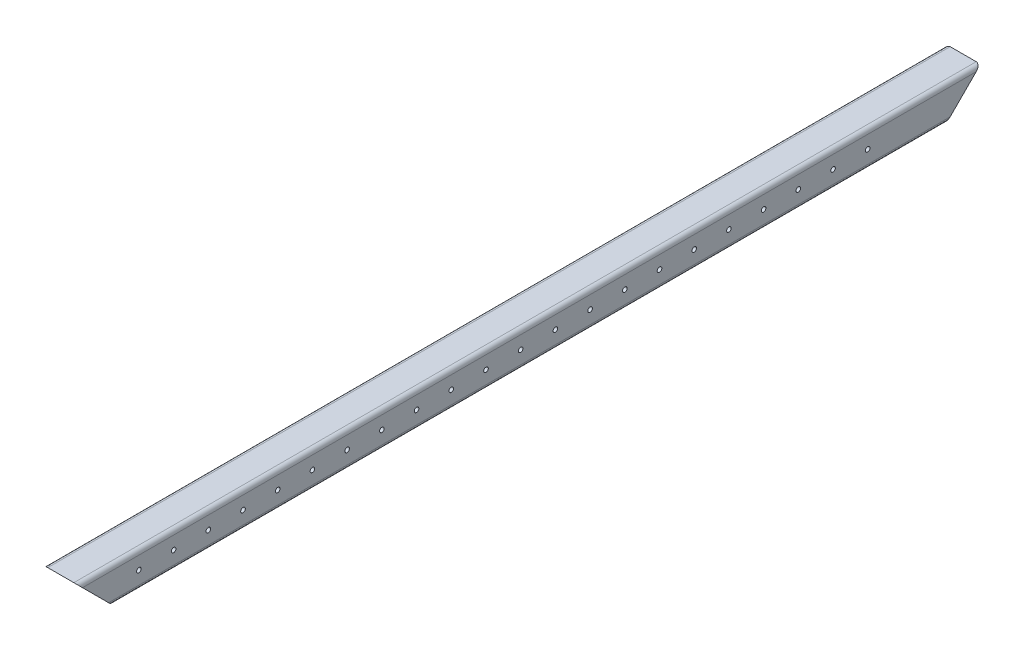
ISO-10303-21;
HEADER;
FILE_DESCRIPTION(('STEP AP214'),'2;1');
FILE_NAME('part.step','',(''),(''),'','','');
FILE_SCHEMA(('AUTOMOTIVE_DESIGN { 1 0 10303 214 1 1 1 1 }'));
ENDSEC;
DATA;
#1=APPLICATION_CONTEXT('core data for automotive mechanical design processes');
#2=APPLICATION_PROTOCOL_DEFINITION('international standard','automotive_design',2000,#1);
#3=PRODUCT_CONTEXT('',#1,'mechanical');
#4=PRODUCT('Part','Part','',(#3));
#5=PRODUCT_RELATED_PRODUCT_CATEGORY('part','',(#4));
#6=PRODUCT_DEFINITION_FORMATION('','',#4);
#7=PRODUCT_DEFINITION_CONTEXT('part definition',#1,'design');
#8=PRODUCT_DEFINITION('design','',#6,#7);
#9=PRODUCT_DEFINITION_SHAPE('','',#8);
#10=(LENGTH_UNIT() NAMED_UNIT(*) SI_UNIT(.MILLI.,.METRE.));
#11=(NAMED_UNIT(*) PLANE_ANGLE_UNIT() SI_UNIT($,.RADIAN.));
#12=(NAMED_UNIT(*) SI_UNIT($,.STERADIAN.) SOLID_ANGLE_UNIT());
#13=UNCERTAINTY_MEASURE_WITH_UNIT(LENGTH_MEASURE(1.E-05),#10,'distance_accuracy_value','');
#14=(GEOMETRIC_REPRESENTATION_CONTEXT(3) GLOBAL_UNCERTAINTY_ASSIGNED_CONTEXT((#13)) GLOBAL_UNIT_ASSIGNED_CONTEXT((#10,
#11,#12)) REPRESENTATION_CONTEXT('',''));
#15=CARTESIAN_POINT('',(0.,0.,0.));
#16=DIRECTION('',(0.,0.,1.));
#17=DIRECTION('',(1.,0.,0.));
#18=AXIS2_PLACEMENT_3D('',#15,#16,#17);
#19=CARTESIAN_POINT('',(-19.049999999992,-19.049999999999,-1320.8));
#20=DIRECTION('',(0.,0.,1.));
#21=DIRECTION('',(1.,0.,0.));
#22=AXIS2_PLACEMENT_3D('',#19,#20,#21);
#23=CYLINDRICAL_SURFACE('',#22,6.35);
#24=DIRECTION('',(0.,0.,1.));
#25=VECTOR('',#24,1.);
#26=CARTESIAN_POINT('',(-25.3999999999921,-19.049999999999,-1320.8));
#27=LINE('',#26,#25);
#28=CARTESIAN_POINT('',(-25.3999999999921,-19.049999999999,-1276.35));
#29=VERTEX_POINT('',#28);
#30=CARTESIAN_POINT('',(-25.4000000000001,-19.05,-44.4499999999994));
#31=VERTEX_POINT('',#30);
#32=EDGE_CURVE('E173',#29,#31,#27,.T.);
#33=ORIENTED_EDGE('',*,*,#32,.F.);
#34=CARTESIAN_POINT('',(-19.049999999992,-19.049999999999,-1276.35));
#35=DIRECTION('',(0.,-0.707106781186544,-0.707106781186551));
#36=DIRECTION('',(0.,-0.707106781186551,0.707106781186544));
#37=AXIS2_PLACEMENT_3D('',#34,#35,#36);
#38=ELLIPSE('',#37,8.98025612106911,6.35);
#39=CARTESIAN_POINT('',(-19.049999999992,-25.399999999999,-1270.));
#40=VERTEX_POINT('',#39);
#41=EDGE_CURVE('E450',#29,#40,#38,.F.);
#42=ORIENTED_EDGE('',*,*,#41,.T.);
#43=DIRECTION('',(0.,0.,1.));
#44=VECTOR('',#43,1.);
#45=CARTESIAN_POINT('',(-19.049999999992,-25.399999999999,-1320.8));
#46=LINE('',#45,#44);
#47=CARTESIAN_POINT('',(-19.05,-25.4,-50.7999999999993));
#48=VERTEX_POINT('',#47);
#49=EDGE_CURVE('E145',#40,#48,#46,.T.);
#50=ORIENTED_EDGE('',*,*,#49,.T.);
#51=CARTESIAN_POINT('',(-19.05,-19.05,-44.4499999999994));
#52=DIRECTION('',(0.,0.707106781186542,-0.707106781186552));
#53=DIRECTION('',(0.,0.707106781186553,0.707106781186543));
#54=AXIS2_PLACEMENT_3D('',#51,#52,#53);
#55=ELLIPSE('',#54,8.98025612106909,6.35);
#56=EDGE_CURVE('E479',#31,#48,#55,.F.);
#57=ORIENTED_EDGE('',*,*,#56,.F.);
#58=EDGE_LOOP('',(#33,#42,#50,#57));
#59=FACE_BOUND('',#58,.T.);
#60=ADVANCED_FACE('F44',(#59),#23,.T.);
#61=CARTESIAN_POINT('',(-25.3999999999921,-19.049999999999,-1320.8));
#62=DIRECTION('',(-1.,0.,0.));
#63=DIRECTION('',(0.,0.,1.));
#64=AXIS2_PLACEMENT_3D('',#61,#62,#63);
#65=PLANE('',#64);
#66=CARTESIAN_POINT('',(-25.3999999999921,9.99200722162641E-13,-1155.7));
#67=DIRECTION('',(-1.,0.,0.));
#68=DIRECTION('',(0.,0.,1.));
#69=AXIS2_PLACEMENT_3D('',#66,#67,#68);
#70=CIRCLE('',#69,3.3654999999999);
#71=CARTESIAN_POINT('',(-25.3999999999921,9.97519317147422E-13,-1152.3345));
#72=VERTEX_POINT('',#71);
#73=EDGE_CURVE('E284',#72,#72,#70,.T.);
#74=ORIENTED_EDGE('',*,*,#73,.F.);
#75=EDGE_LOOP('',(#74));
#76=FACE_BOUND('',#75,.T.);
#77=CARTESIAN_POINT('',(-25.3999999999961,9.99200722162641E-13,-1104.9));
#78=DIRECTION('',(-1.,0.,0.));
#79=DIRECTION('',(0.,0.,1.));
#80=AXIS2_PLACEMENT_3D('',#77,#78,#79);
#81=CIRCLE('',#80,3.3654999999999);
#82=CARTESIAN_POINT('',(-25.3999999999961,9.97519317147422E-13,-1101.5345));
#83=VERTEX_POINT('',#82);
#84=EDGE_CURVE('E281',#83,#83,#81,.T.);
#85=ORIENTED_EDGE('',*,*,#84,.F.);
#86=EDGE_LOOP('',(#85));
#87=FACE_BOUND('',#86,.T.);
#88=CARTESIAN_POINT('',(-25.3999999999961,0.,-1054.1));
#89=DIRECTION('',(-1.,0.,0.));
#90=DIRECTION('',(0.,0.,1.));
#91=AXIS2_PLACEMENT_3D('',#88,#89,#90);
#92=CIRCLE('',#91,3.3654999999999);
#93=CARTESIAN_POINT('',(-25.3999999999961,0.,-1050.7345));
#94=VERTEX_POINT('',#93);
#95=EDGE_CURVE('E299',#94,#94,#92,.T.);
#96=ORIENTED_EDGE('',*,*,#95,.F.);
#97=EDGE_LOOP('',(#96));
#98=FACE_BOUND('',#97,.T.);
#99=CARTESIAN_POINT('',(-25.3999999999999,0.,-1003.3));
#100=DIRECTION('',(-1.,0.,0.));
#101=DIRECTION('',(0.,0.,1.));
#102=AXIS2_PLACEMENT_3D('',#99,#100,#101);
#103=CIRCLE('',#102,3.3654999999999);
#104=CARTESIAN_POINT('',(-25.3999999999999,0.,-999.934499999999));
#105=VERTEX_POINT('',#104);
#106=EDGE_CURVE('E306',#105,#105,#103,.T.);
#107=ORIENTED_EDGE('',*,*,#106,.F.);
#108=EDGE_LOOP('',(#107));
#109=FACE_BOUND('',#108,.T.);
#110=CARTESIAN_POINT('',(-25.3999999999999,0.,-952.499999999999));
#111=DIRECTION('',(-1.,0.,0.));
#112=DIRECTION('',(0.,0.,1.));
#113=AXIS2_PLACEMENT_3D('',#110,#111,#112);
#114=CIRCLE('',#113,3.3654999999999);
#115=CARTESIAN_POINT('',(-25.3999999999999,0.,-949.1345));
#116=VERTEX_POINT('',#115);
#117=EDGE_CURVE('E313',#116,#116,#114,.T.);
#118=ORIENTED_EDGE('',*,*,#117,.F.);
#119=EDGE_LOOP('',(#118));
#120=FACE_BOUND('',#119,.T.);
#121=CARTESIAN_POINT('',(-25.3999999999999,0.,-901.699999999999));
#122=DIRECTION('',(-1.,0.,0.));
#123=DIRECTION('',(0.,0.,1.));
#124=AXIS2_PLACEMENT_3D('',#121,#122,#123);
#125=CIRCLE('',#124,3.36550000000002);
#126=CARTESIAN_POINT('',(-25.3999999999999,0.,-898.334499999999));
#127=VERTEX_POINT('',#126);
#128=EDGE_CURVE('E320',#127,#127,#125,.T.);
#129=ORIENTED_EDGE('',*,*,#128,.F.);
#130=EDGE_LOOP('',(#129));
#131=FACE_BOUND('',#130,.T.);
#132=CARTESIAN_POINT('',(-25.3999999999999,9.99200722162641E-13,-850.9));
#133=DIRECTION('',(-1.,0.,0.));
#134=DIRECTION('',(0.,0.,1.));
#135=AXIS2_PLACEMENT_3D('',#132,#133,#134);
#136=CIRCLE('',#135,3.36550000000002);
#137=CARTESIAN_POINT('',(-25.3999999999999,9.97519317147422E-13,-847.5345));
#138=VERTEX_POINT('',#137);
#139=EDGE_CURVE('E327',#138,#138,#136,.T.);
#140=ORIENTED_EDGE('',*,*,#139,.F.);
#141=EDGE_LOOP('',(#140));
#142=FACE_BOUND('',#141,.T.);
#143=CARTESIAN_POINT('',(-25.3999999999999,9.99200722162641E-13,-800.099999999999));
#144=DIRECTION('',(-1.,0.,0.));
#145=DIRECTION('',(0.,0.,1.));
#146=AXIS2_PLACEMENT_3D('',#143,#144,#145);
#147=CIRCLE('',#146,3.36550000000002);
#148=CARTESIAN_POINT('',(-25.3999999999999,9.97519317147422E-13,-796.734499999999));
#149=VERTEX_POINT('',#148);
#150=EDGE_CURVE('E334',#149,#149,#147,.T.);
#151=ORIENTED_EDGE('',*,*,#150,.F.);
#152=EDGE_LOOP('',(#151));
#153=FACE_BOUND('',#152,.T.);
#154=CARTESIAN_POINT('',(-25.3999999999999,9.99200722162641E-13,-749.3));
#155=DIRECTION('',(-1.,0.,0.));
#156=DIRECTION('',(0.,0.,1.));
#157=AXIS2_PLACEMENT_3D('',#154,#155,#156);
#158=CIRCLE('',#157,3.36550000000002);
#159=CARTESIAN_POINT('',(-25.3999999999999,9.97519317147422E-13,-745.9345));
#160=VERTEX_POINT('',#159);
#161=EDGE_CURVE('E341',#160,#160,#158,.T.);
#162=ORIENTED_EDGE('',*,*,#161,.F.);
#163=EDGE_LOOP('',(#162));
#164=FACE_BOUND('',#163,.T.);
#165=CARTESIAN_POINT('',(-25.3999999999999,9.99200722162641E-13,-698.499999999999));
#166=DIRECTION('',(-1.,0.,0.));
#167=DIRECTION('',(0.,0.,1.));
#168=AXIS2_PLACEMENT_3D('',#165,#166,#167);
#169=CIRCLE('',#168,3.36550000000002);
#170=CARTESIAN_POINT('',(-25.3999999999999,9.97519317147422E-13,-695.134499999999));
#171=VERTEX_POINT('',#170);
#172=EDGE_CURVE('E348',#171,#171,#169,.T.);
#173=ORIENTED_EDGE('',*,*,#172,.F.);
#174=EDGE_LOOP('',(#173));
#175=FACE_BOUND('',#174,.T.);
#176=CARTESIAN_POINT('',(-25.3999999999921,9.99200722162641E-13,-647.7));
#177=DIRECTION('',(-1.,0.,0.));
#178=DIRECTION('',(0.,0.,1.));
#179=AXIS2_PLACEMENT_3D('',#176,#177,#178);
#180=CIRCLE('',#179,3.36550000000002);
#181=CARTESIAN_POINT('',(-25.3999999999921,9.97519317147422E-13,-644.3345));
#182=VERTEX_POINT('',#181);
#183=EDGE_CURVE('E355',#182,#182,#180,.T.);
#184=ORIENTED_EDGE('',*,*,#183,.F.);
#185=EDGE_LOOP('',(#184));
#186=FACE_BOUND('',#185,.T.);
#187=CARTESIAN_POINT('',(-25.3999999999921,0.,-596.9));
#188=DIRECTION('',(-1.,0.,0.));
#189=DIRECTION('',(0.,0.,1.));
#190=AXIS2_PLACEMENT_3D('',#187,#188,#189);
#191=CIRCLE('',#190,3.36550000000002);
#192=CARTESIAN_POINT('',(-25.3999999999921,0.,-593.5345));
#193=VERTEX_POINT('',#192);
#194=EDGE_CURVE('E362',#193,#193,#191,.T.);
#195=ORIENTED_EDGE('',*,*,#194,.F.);
#196=EDGE_LOOP('',(#195));
#197=FACE_BOUND('',#196,.T.);
#198=CARTESIAN_POINT('',(-25.3999999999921,0.,-546.1));
#199=DIRECTION('',(-1.,0.,0.));
#200=DIRECTION('',(0.,0.,1.));
#201=AXIS2_PLACEMENT_3D('',#198,#199,#200);
#202=CIRCLE('',#201,3.36550000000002);
#203=CARTESIAN_POINT('',(-25.3999999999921,0.,-542.7345));
#204=VERTEX_POINT('',#203);
#205=EDGE_CURVE('E369',#204,#204,#202,.T.);
#206=ORIENTED_EDGE('',*,*,#205,.F.);
#207=EDGE_LOOP('',(#206));
#208=FACE_BOUND('',#207,.T.);
#209=CARTESIAN_POINT('',(-25.3999999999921,0.,-495.3));
#210=DIRECTION('',(-1.,0.,0.));
#211=DIRECTION('',(0.,0.,1.));
#212=AXIS2_PLACEMENT_3D('',#209,#210,#211);
#213=CIRCLE('',#212,3.36550000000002);
#214=CARTESIAN_POINT('',(-25.3999999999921,0.,-491.9345));
#215=VERTEX_POINT('',#214);
#216=EDGE_CURVE('E376',#215,#215,#213,.T.);
#217=ORIENTED_EDGE('',*,*,#216,.F.);
#218=EDGE_LOOP('',(#217));
#219=FACE_BOUND('',#218,.T.);
#220=CARTESIAN_POINT('',(-25.3999999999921,0.,-444.499999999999));
#221=DIRECTION('',(-1.,0.,0.));
#222=DIRECTION('',(0.,0.,1.));
#223=AXIS2_PLACEMENT_3D('',#220,#221,#222);
#224=CIRCLE('',#223,3.36550000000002);
#225=CARTESIAN_POINT('',(-25.3999999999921,0.,-441.134499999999));
#226=VERTEX_POINT('',#225);
#227=EDGE_CURVE('E383',#226,#226,#224,.T.);
#228=ORIENTED_EDGE('',*,*,#227,.F.);
#229=EDGE_LOOP('',(#228));
#230=FACE_BOUND('',#229,.T.);
#231=CARTESIAN_POINT('',(-25.3999999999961,0.,-393.7));
#232=DIRECTION('',(-1.,0.,0.));
#233=DIRECTION('',(0.,0.,1.));
#234=AXIS2_PLACEMENT_3D('',#231,#232,#233);
#235=CIRCLE('',#234,3.36550000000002);
#236=CARTESIAN_POINT('',(-25.3999999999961,0.,-390.3345));
#237=VERTEX_POINT('',#236);
#238=EDGE_CURVE('E390',#237,#237,#235,.T.);
#239=ORIENTED_EDGE('',*,*,#238,.F.);
#240=EDGE_LOOP('',(#239));
#241=FACE_BOUND('',#240,.T.);
#242=CARTESIAN_POINT('',(-25.3999999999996,0.,-342.9));
#243=DIRECTION('',(-1.,0.,0.));
#244=DIRECTION('',(0.,0.,1.));
#245=AXIS2_PLACEMENT_3D('',#242,#243,#244);
#246=CIRCLE('',#245,3.36550000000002);
#247=CARTESIAN_POINT('',(-25.3999999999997,0.,-339.5345));
#248=VERTEX_POINT('',#247);
#249=EDGE_CURVE('E397',#248,#248,#246,.T.);
#250=ORIENTED_EDGE('',*,*,#249,.F.);
#251=EDGE_LOOP('',(#250));
#252=FACE_BOUND('',#251,.T.);
#253=CARTESIAN_POINT('',(-25.3999999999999,0.,-292.1));
#254=DIRECTION('',(-1.,0.,0.));
#255=DIRECTION('',(0.,0.,1.));
#256=AXIS2_PLACEMENT_3D('',#253,#254,#255);
#257=CIRCLE('',#256,3.36550000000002);
#258=CARTESIAN_POINT('',(-25.3999999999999,0.,-288.7345));
#259=VERTEX_POINT('',#258);
#260=EDGE_CURVE('E404',#259,#259,#257,.T.);
#261=ORIENTED_EDGE('',*,*,#260,.F.);
#262=EDGE_LOOP('',(#261));
#263=FACE_BOUND('',#262,.T.);
#264=CARTESIAN_POINT('',(-25.3999999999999,9.99200722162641E-13,-241.3));
#265=DIRECTION('',(-1.,0.,0.));
#266=DIRECTION('',(0.,0.,1.));
#267=AXIS2_PLACEMENT_3D('',#264,#265,#266);
#268=CIRCLE('',#267,3.36550000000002);
#269=CARTESIAN_POINT('',(-25.3999999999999,9.97519317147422E-13,-237.9345));
#270=VERTEX_POINT('',#269);
#271=EDGE_CURVE('E411',#270,#270,#268,.T.);
#272=ORIENTED_EDGE('',*,*,#271,.F.);
#273=EDGE_LOOP('',(#272));
#274=FACE_BOUND('',#273,.T.);
#275=CARTESIAN_POINT('',(-25.3999999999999,9.99200722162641E-13,-190.5));
#276=DIRECTION('',(-1.,0.,0.));
#277=DIRECTION('',(0.,0.,1.));
#278=AXIS2_PLACEMENT_3D('',#275,#276,#277);
#279=CIRCLE('',#278,3.36549999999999);
#280=CARTESIAN_POINT('',(-25.3999999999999,9.97519317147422E-13,-187.1345));
#281=VERTEX_POINT('',#280);
#282=EDGE_CURVE('E418',#281,#281,#279,.T.);
#283=ORIENTED_EDGE('',*,*,#282,.F.);
#284=EDGE_LOOP('',(#283));
#285=FACE_BOUND('',#284,.T.);
#286=CARTESIAN_POINT('',(-25.3999999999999,0.,-139.7));
#287=DIRECTION('',(-1.,0.,0.));
#288=DIRECTION('',(0.,0.,1.));
#289=AXIS2_PLACEMENT_3D('',#286,#287,#288);
#290=CIRCLE('',#289,3.36549999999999);
#291=CARTESIAN_POINT('',(-25.3999999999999,0.,-136.3345));
#292=VERTEX_POINT('',#291);
#293=EDGE_CURVE('E425',#292,#292,#290,.T.);
#294=ORIENTED_EDGE('',*,*,#293,.F.);
#295=EDGE_LOOP('',(#294));
#296=FACE_BOUND('',#295,.T.);
#297=CARTESIAN_POINT('',(-25.3999999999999,0.,-88.9));
#298=DIRECTION('',(-1.,0.,0.));
#299=DIRECTION('',(0.,0.,1.));
#300=AXIS2_PLACEMENT_3D('',#297,#298,#299);
#301=CIRCLE('',#300,3.36549999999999);
#302=CARTESIAN_POINT('',(-25.3999999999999,0.,-85.5345));
#303=VERTEX_POINT('',#302);
#304=EDGE_CURVE('E432',#303,#303,#301,.T.);
#305=ORIENTED_EDGE('',*,*,#304,.F.);
#306=EDGE_LOOP('',(#305));
#307=FACE_BOUND('',#306,.T.);
#308=DIRECTION('',(0.,0.,1.));
#309=VECTOR('',#308,1.);
#310=CARTESIAN_POINT('',(-25.3999999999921,19.0500000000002,-1320.8));
#311=LINE('',#310,#309);
#312=CARTESIAN_POINT('',(-25.3999999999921,19.0500000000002,-1314.45));
#313=VERTEX_POINT('',#312);
#314=CARTESIAN_POINT('',(-25.4000000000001,19.05,-6.34999999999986));
#315=VERTEX_POINT('',#314);
#316=EDGE_CURVE('E162',#313,#315,#311,.T.);
#317=ORIENTED_EDGE('',*,*,#316,.F.);
#318=DIRECTION('',(0.,-0.707106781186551,0.707106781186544));
#319=VECTOR('',#318,1.);
#320=CARTESIAN_POINT('',(-25.3999999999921,3.17500000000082,-1298.575));
#321=LINE('',#320,#319);
#322=EDGE_CURVE('E447',#313,#29,#321,.T.);
#323=ORIENTED_EDGE('',*,*,#322,.T.);
#324=ORIENTED_EDGE('',*,*,#32,.T.);
#325=DIRECTION('',(0.,-0.707106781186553,-0.707106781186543));
#326=VECTOR('',#325,1.);
#327=CARTESIAN_POINT('',(-25.3999999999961,-657.225,-682.62499999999));
#328=LINE('',#327,#326);
#329=EDGE_CURVE('E476',#315,#31,#328,.T.);
#330=ORIENTED_EDGE('',*,*,#329,.F.);
#331=EDGE_LOOP('',(#317,#323,#324,#330));
#332=FACE_BOUND('',#331,.T.);
#333=ADVANCED_FACE('F497',(#76,#87,#98,#109,#120,#131,#142,#153,#164,#175,#186,#197,#208,#219,
#230,#241,#252,#263,#274,#285,#296,#307,#332),#65,.T.);
#334=CARTESIAN_POINT('',(-19.049999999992,19.0500000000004,-1320.8));
#335=DIRECTION('',(0.,0.,1.));
#336=DIRECTION('',(1.,0.,0.));
#337=AXIS2_PLACEMENT_3D('',#334,#335,#336);
#338=CYLINDRICAL_SURFACE('',#337,6.35);
#339=DIRECTION('',(0.,0.,1.));
#340=VECTOR('',#339,1.);
#341=CARTESIAN_POINT('',(-19.049999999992,25.4000000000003,-1320.8));
#342=LINE('',#341,#340);
#343=CARTESIAN_POINT('',(-19.049999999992,25.4000000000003,-1320.8));
#344=VERTEX_POINT('',#343);
#345=CARTESIAN_POINT('',(-19.05,25.4,0.));
#346=VERTEX_POINT('',#345);
#347=EDGE_CURVE('E160',#344,#346,#342,.T.);
#348=ORIENTED_EDGE('',*,*,#347,.F.);
#349=CARTESIAN_POINT('',(-19.049999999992,19.0500000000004,-1314.45));
#350=DIRECTION('',(0.,-0.707106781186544,-0.707106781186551));
#351=DIRECTION('',(0.,-0.707106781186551,0.707106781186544));
#352=AXIS2_PLACEMENT_3D('',#349,#350,#351);
#353=ELLIPSE('',#352,8.98025612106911,6.35);
#354=EDGE_CURVE('E141',#344,#313,#353,.F.);
#355=ORIENTED_EDGE('',*,*,#354,.T.);
#356=ORIENTED_EDGE('',*,*,#316,.T.);
#357=CARTESIAN_POINT('',(-19.05,19.05,-6.34999999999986));
#358=DIRECTION('',(0.,0.707106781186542,-0.707106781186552));
#359=DIRECTION('',(0.,0.707106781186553,0.707106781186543));
#360=AXIS2_PLACEMENT_3D('',#357,#358,#359);
#361=ELLIPSE('',#360,8.98025612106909,6.35);
#362=EDGE_CURVE('E473',#346,#315,#361,.F.);
#363=ORIENTED_EDGE('',*,*,#362,.F.);
#364=EDGE_LOOP('',(#348,#355,#356,#363));
#365=FACE_BOUND('',#364,.T.);
#366=ADVANCED_FACE('F495',(#365),#338,.T.);
#367=CARTESIAN_POINT('',(19.050000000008,19.0500000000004,-1320.8));
#368=DIRECTION('',(0.,0.,1.));
#369=DIRECTION('',(1.,0.,0.));
#370=AXIS2_PLACEMENT_3D('',#367,#368,#369);
#371=CYLINDRICAL_SURFACE('',#370,6.35);
#372=DIRECTION('',(0.,0.,1.));
#373=VECTOR('',#372,1.);
#374=CARTESIAN_POINT('',(25.4000000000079,19.0500000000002,-1320.8));
#375=LINE('',#374,#373);
#376=CARTESIAN_POINT('',(25.4000000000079,19.0500000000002,-1314.45));
#377=VERTEX_POINT('',#376);
#378=CARTESIAN_POINT('',(25.4000000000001,19.05,-6.34999999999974));
#379=VERTEX_POINT('',#378);
#380=EDGE_CURVE('E154',#377,#379,#375,.T.);
#381=ORIENTED_EDGE('',*,*,#380,.F.);
#382=CARTESIAN_POINT('',(19.050000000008,19.0500000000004,-1314.45));
#383=DIRECTION('',(0.,-0.707106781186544,-0.707106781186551));
#384=DIRECTION('',(0.,-0.707106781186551,0.707106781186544));
#385=AXIS2_PLACEMENT_3D('',#382,#383,#384);
#386=ELLIPSE('',#385,8.98025612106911,6.35);
#387=CARTESIAN_POINT('',(19.050000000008,25.4000000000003,-1320.8));
#388=VERTEX_POINT('',#387);
#389=EDGE_CURVE('E138',#377,#388,#386,.F.);
#390=ORIENTED_EDGE('',*,*,#389,.T.);
#391=DIRECTION('',(0.,0.,1.));
#392=VECTOR('',#391,1.);
#393=CARTESIAN_POINT('',(19.050000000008,25.4000000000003,-1320.8));
#394=LINE('',#393,#392);
#395=CARTESIAN_POINT('',(19.05,25.4,0.));
#396=VERTEX_POINT('',#395);
#397=EDGE_CURVE('E152',#388,#396,#394,.T.);
#398=ORIENTED_EDGE('',*,*,#397,.T.);
#399=CARTESIAN_POINT('',(19.05,19.05,-6.34999999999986));
#400=DIRECTION('',(0.,0.707106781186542,-0.707106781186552));
#401=DIRECTION('',(0.,0.707106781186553,0.707106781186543));
#402=AXIS2_PLACEMENT_3D('',#399,#400,#401);
#403=ELLIPSE('',#402,8.98025612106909,6.35);
#404=EDGE_CURVE('E471',#379,#396,#403,.F.);
#405=ORIENTED_EDGE('',*,*,#404,.F.);
#406=EDGE_LOOP('',(#381,#390,#398,#405));
#407=FACE_BOUND('',#406,.T.);
#408=ADVANCED_FACE('F150',(#407),#371,.T.);
#409=CARTESIAN_POINT('',(25.4000000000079,-19.049999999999,-1320.8));
#410=DIRECTION('',(1.,0.,0.));
#411=DIRECTION('',(0.,0.,-1.));
#412=AXIS2_PLACEMENT_3D('',#409,#410,#411);
#413=PLANE('',#412);
#414=CARTESIAN_POINT('',(25.4000000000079,9.99200722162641E-13,-1155.7));
#415=DIRECTION('',(1.,0.,0.));
#416=DIRECTION('',(0.,0.,-1.));
#417=AXIS2_PLACEMENT_3D('',#414,#415,#416);
#418=CIRCLE('',#417,3.3654999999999);
#419=CARTESIAN_POINT('',(25.4000000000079,1.00088212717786E-12,-1159.0655));
#420=VERTEX_POINT('',#419);
#421=EDGE_CURVE('E738',#420,#420,#418,.T.);
#422=ORIENTED_EDGE('',*,*,#421,.F.);
#423=EDGE_LOOP('',(#422));
#424=FACE_BOUND('',#423,.T.);
#425=CARTESIAN_POINT('',(25.4000000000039,9.99200722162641E-13,-1104.9));
#426=DIRECTION('',(1.,0.,0.));
#427=DIRECTION('',(0.,0.,-1.));
#428=AXIS2_PLACEMENT_3D('',#425,#426,#427);
#429=CIRCLE('',#428,3.3654999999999);
#430=CARTESIAN_POINT('',(25.4000000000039,1.00088212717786E-12,-1108.2655));
#431=VERTEX_POINT('',#430);
#432=EDGE_CURVE('E277',#431,#431,#429,.T.);
#433=ORIENTED_EDGE('',*,*,#432,.F.);
#434=EDGE_LOOP('',(#433));
#435=FACE_BOUND('',#434,.T.);
#436=CARTESIAN_POINT('',(25.4000000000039,0.,-1054.1));
#437=DIRECTION('',(1.,0.,0.));
#438=DIRECTION('',(0.,0.,-1.));
#439=AXIS2_PLACEMENT_3D('',#436,#437,#438);
#440=CIRCLE('',#439,3.3654999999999);
#441=CARTESIAN_POINT('',(25.4000000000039,0.,-1057.4655));
#442=VERTEX_POINT('',#441);
#443=EDGE_CURVE('E273',#442,#442,#440,.T.);
#444=ORIENTED_EDGE('',*,*,#443,.F.);
#445=EDGE_LOOP('',(#444));
#446=FACE_BOUND('',#445,.T.);
#447=CARTESIAN_POINT('',(25.4000000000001,0.,-1003.3));
#448=DIRECTION('',(1.,0.,0.));
#449=DIRECTION('',(0.,0.,-1.));
#450=AXIS2_PLACEMENT_3D('',#447,#448,#449);
#451=CIRCLE('',#450,3.3654999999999);
#452=CARTESIAN_POINT('',(25.4000000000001,0.,-1006.6655));
#453=VERTEX_POINT('',#452);
#454=EDGE_CURVE('E269',#453,#453,#451,.T.);
#455=ORIENTED_EDGE('',*,*,#454,.F.);
#456=EDGE_LOOP('',(#455));
#457=FACE_BOUND('',#456,.T.);
#458=CARTESIAN_POINT('',(25.4000000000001,9.99200722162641E-13,-952.5));
#459=DIRECTION('',(1.,0.,0.));
#460=DIRECTION('',(0.,0.,-1.));
#461=AXIS2_PLACEMENT_3D('',#458,#459,#460);
#462=CIRCLE('',#461,3.3654999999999);
#463=CARTESIAN_POINT('',(25.4000000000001,1.00088212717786E-12,-955.8655));
#464=VERTEX_POINT('',#463);
#465=EDGE_CURVE('E264',#464,#464,#462,.T.);
#466=ORIENTED_EDGE('',*,*,#465,.F.);
#467=EDGE_LOOP('',(#466));
#468=FACE_BOUND('',#467,.T.);
#469=CARTESIAN_POINT('',(25.4000000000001,9.99200722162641E-13,-901.7));
#470=DIRECTION('',(1.,0.,0.));
#471=DIRECTION('',(0.,0.,-1.));
#472=AXIS2_PLACEMENT_3D('',#469,#470,#471);
#473=CIRCLE('',#472,3.36550000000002);
#474=CARTESIAN_POINT('',(25.4000000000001,1.00088212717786E-12,-905.0655));
#475=VERTEX_POINT('',#474);
#476=EDGE_CURVE('E259',#475,#475,#473,.T.);
#477=ORIENTED_EDGE('',*,*,#476,.F.);
#478=EDGE_LOOP('',(#477));
#479=FACE_BOUND('',#478,.T.);
#480=CARTESIAN_POINT('',(25.4000000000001,9.99200722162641E-13,-850.9));
#481=DIRECTION('',(1.,0.,0.));
#482=DIRECTION('',(0.,0.,-1.));
#483=AXIS2_PLACEMENT_3D('',#480,#481,#482);
#484=CIRCLE('',#483,3.36550000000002);
#485=CARTESIAN_POINT('',(25.4000000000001,1.00088212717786E-12,-854.2655));
#486=VERTEX_POINT('',#485);
#487=EDGE_CURVE('E254',#486,#486,#484,.T.);
#488=ORIENTED_EDGE('',*,*,#487,.F.);
#489=EDGE_LOOP('',(#488));
#490=FACE_BOUND('',#489,.T.);
#491=CARTESIAN_POINT('',(25.4000000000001,9.99200722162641E-13,-800.1));
#492=DIRECTION('',(1.,0.,0.));
#493=DIRECTION('',(0.,0.,-1.));
#494=AXIS2_PLACEMENT_3D('',#491,#492,#493);
#495=CIRCLE('',#494,3.36550000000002);
#496=CARTESIAN_POINT('',(25.4000000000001,1.00088212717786E-12,-803.4655));
#497=VERTEX_POINT('',#496);
#498=EDGE_CURVE('E249',#497,#497,#495,.T.);
#499=ORIENTED_EDGE('',*,*,#498,.F.);
#500=EDGE_LOOP('',(#499));
#501=FACE_BOUND('',#500,.T.);
#502=CARTESIAN_POINT('',(25.4000000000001,9.99200722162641E-13,-749.3));
#503=DIRECTION('',(1.,0.,0.));
#504=DIRECTION('',(0.,0.,-1.));
#505=AXIS2_PLACEMENT_3D('',#502,#503,#504);
#506=CIRCLE('',#505,3.36550000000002);
#507=CARTESIAN_POINT('',(25.4000000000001,1.00088212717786E-12,-752.6655));
#508=VERTEX_POINT('',#507);
#509=EDGE_CURVE('E244',#508,#508,#506,.T.);
#510=ORIENTED_EDGE('',*,*,#509,.F.);
#511=EDGE_LOOP('',(#510));
#512=FACE_BOUND('',#511,.T.);
#513=CARTESIAN_POINT('',(25.4000000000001,9.99200722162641E-13,-698.5));
#514=DIRECTION('',(1.,0.,0.));
#515=DIRECTION('',(0.,0.,-1.));
#516=AXIS2_PLACEMENT_3D('',#513,#514,#515);
#517=CIRCLE('',#516,3.36550000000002);
#518=CARTESIAN_POINT('',(25.4000000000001,1.00088212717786E-12,-701.8655));
#519=VERTEX_POINT('',#518);
#520=EDGE_CURVE('E239',#519,#519,#517,.T.);
#521=ORIENTED_EDGE('',*,*,#520,.F.);
#522=EDGE_LOOP('',(#521));
#523=FACE_BOUND('',#522,.T.);
#524=CARTESIAN_POINT('',(25.4000000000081,9.99200722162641E-13,-647.7));
#525=DIRECTION('',(1.,0.,0.));
#526=DIRECTION('',(0.,0.,-1.));
#527=AXIS2_PLACEMENT_3D('',#524,#525,#526);
#528=CIRCLE('',#527,3.36550000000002);
#529=CARTESIAN_POINT('',(25.4000000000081,1.00088212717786E-12,-651.0655));
#530=VERTEX_POINT('',#529);
#531=EDGE_CURVE('E234',#530,#530,#528,.T.);
#532=ORIENTED_EDGE('',*,*,#531,.F.);
#533=EDGE_LOOP('',(#532));
#534=FACE_BOUND('',#533,.T.);
#535=CARTESIAN_POINT('',(25.4000000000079,0.,-596.9));
#536=DIRECTION('',(1.,0.,0.));
#537=DIRECTION('',(0.,0.,-1.));
#538=AXIS2_PLACEMENT_3D('',#535,#536,#537);
#539=CIRCLE('',#538,3.36550000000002);
#540=CARTESIAN_POINT('',(25.4000000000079,0.,-600.2655));
#541=VERTEX_POINT('',#540);
#542=EDGE_CURVE('E229',#541,#541,#539,.T.);
#543=ORIENTED_EDGE('',*,*,#542,.F.);
#544=EDGE_LOOP('',(#543));
#545=FACE_BOUND('',#544,.T.);
#546=CARTESIAN_POINT('',(25.4000000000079,0.,-546.1));
#547=DIRECTION('',(1.,0.,0.));
#548=DIRECTION('',(0.,0.,-1.));
#549=AXIS2_PLACEMENT_3D('',#546,#547,#548);
#550=CIRCLE('',#549,3.36550000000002);
#551=CARTESIAN_POINT('',(25.4000000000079,0.,-549.4655));
#552=VERTEX_POINT('',#551);
#553=EDGE_CURVE('E224',#552,#552,#550,.T.);
#554=ORIENTED_EDGE('',*,*,#553,.F.);
#555=EDGE_LOOP('',(#554));
#556=FACE_BOUND('',#555,.T.);
#557=CARTESIAN_POINT('',(25.4000000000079,0.,-495.3));
#558=DIRECTION('',(1.,0.,0.));
#559=DIRECTION('',(0.,0.,-1.));
#560=AXIS2_PLACEMENT_3D('',#557,#558,#559);
#561=CIRCLE('',#560,3.36550000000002);
#562=CARTESIAN_POINT('',(25.4000000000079,0.,-498.6655));
#563=VERTEX_POINT('',#562);
#564=EDGE_CURVE('E219',#563,#563,#561,.T.);
#565=ORIENTED_EDGE('',*,*,#564,.F.);
#566=EDGE_LOOP('',(#565));
#567=FACE_BOUND('',#566,.T.);
#568=CARTESIAN_POINT('',(25.4000000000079,0.,-444.500000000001));
#569=DIRECTION('',(1.,0.,0.));
#570=DIRECTION('',(0.,0.,-1.));
#571=AXIS2_PLACEMENT_3D('',#568,#569,#570);
#572=CIRCLE('',#571,3.36550000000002);
#573=CARTESIAN_POINT('',(25.4000000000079,0.,-447.865500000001));
#574=VERTEX_POINT('',#573);
#575=EDGE_CURVE('E214',#574,#574,#572,.T.);
#576=ORIENTED_EDGE('',*,*,#575,.F.);
#577=EDGE_LOOP('',(#576));
#578=FACE_BOUND('',#577,.T.);
#579=CARTESIAN_POINT('',(25.4000000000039,0.,-393.7));
#580=DIRECTION('',(1.,0.,0.));
#581=DIRECTION('',(0.,0.,-1.));
#582=AXIS2_PLACEMENT_3D('',#579,#580,#581);
#583=CIRCLE('',#582,3.36550000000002);
#584=CARTESIAN_POINT('',(25.4000000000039,0.,-397.0655));
#585=VERTEX_POINT('',#584);
#586=EDGE_CURVE('E209',#585,#585,#583,.T.);
#587=ORIENTED_EDGE('',*,*,#586,.F.);
#588=EDGE_LOOP('',(#587));
#589=FACE_BOUND('',#588,.T.);
#590=CARTESIAN_POINT('',(25.4000000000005,9.99200722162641E-13,-342.9));
#591=DIRECTION('',(1.,0.,0.));
#592=DIRECTION('',(0.,0.,-1.));
#593=AXIS2_PLACEMENT_3D('',#590,#591,#592);
#594=CIRCLE('',#593,3.36550000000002);
#595=CARTESIAN_POINT('',(25.4000000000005,1.00088212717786E-12,-346.2655));
#596=VERTEX_POINT('',#595);
#597=EDGE_CURVE('E204',#596,#596,#594,.T.);
#598=ORIENTED_EDGE('',*,*,#597,.F.);
#599=EDGE_LOOP('',(#598));
#600=FACE_BOUND('',#599,.T.);
#601=CARTESIAN_POINT('',(25.4000000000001,9.99200722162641E-13,-292.1));
#602=DIRECTION('',(1.,0.,0.));
#603=DIRECTION('',(0.,0.,-1.));
#604=AXIS2_PLACEMENT_3D('',#601,#602,#603);
#605=CIRCLE('',#604,3.36550000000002);
#606=CARTESIAN_POINT('',(25.4000000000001,1.00088212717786E-12,-295.4655));
#607=VERTEX_POINT('',#606);
#608=EDGE_CURVE('E199',#607,#607,#605,.T.);
#609=ORIENTED_EDGE('',*,*,#608,.F.);
#610=EDGE_LOOP('',(#609));
#611=FACE_BOUND('',#610,.T.);
#612=CARTESIAN_POINT('',(25.4000000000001,9.99200722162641E-13,-241.3));
#613=DIRECTION('',(1.,0.,0.));
#614=DIRECTION('',(0.,0.,-1.));
#615=AXIS2_PLACEMENT_3D('',#612,#613,#614);
#616=CIRCLE('',#615,3.36550000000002);
#617=CARTESIAN_POINT('',(25.4000000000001,1.00088212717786E-12,-244.6655));
#618=VERTEX_POINT('',#617);
#619=EDGE_CURVE('E194',#618,#618,#616,.T.);
#620=ORIENTED_EDGE('',*,*,#619,.F.);
#621=EDGE_LOOP('',(#620));
#622=FACE_BOUND('',#621,.T.);
#623=CARTESIAN_POINT('',(25.4000000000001,9.99200722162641E-13,-190.5));
#624=DIRECTION('',(1.,0.,0.));
#625=DIRECTION('',(0.,0.,-1.));
#626=AXIS2_PLACEMENT_3D('',#623,#624,#625);
#627=CIRCLE('',#626,3.36549999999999);
#628=CARTESIAN_POINT('',(25.4000000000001,1.00088212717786E-12,-193.8655));
#629=VERTEX_POINT('',#628);
#630=EDGE_CURVE('E189',#629,#629,#627,.T.);
#631=ORIENTED_EDGE('',*,*,#630,.F.);
#632=EDGE_LOOP('',(#631));
#633=FACE_BOUND('',#632,.T.);
#634=CARTESIAN_POINT('',(25.4000000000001,0.,-139.7));
#635=DIRECTION('',(1.,0.,0.));
#636=DIRECTION('',(0.,0.,-1.));
#637=AXIS2_PLACEMENT_3D('',#634,#635,#636);
#638=CIRCLE('',#637,3.36549999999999);
#639=CARTESIAN_POINT('',(25.4000000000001,0.,-143.0655));
#640=VERTEX_POINT('',#639);
#641=EDGE_CURVE('E184',#640,#640,#638,.T.);
#642=ORIENTED_EDGE('',*,*,#641,.F.);
#643=EDGE_LOOP('',(#642));
#644=FACE_BOUND('',#643,.T.);
#645=CARTESIAN_POINT('',(25.4000000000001,0.,-88.9));
#646=DIRECTION('',(1.,0.,0.));
#647=DIRECTION('',(0.,0.,-1.));
#648=AXIS2_PLACEMENT_3D('',#645,#646,#647);
#649=CIRCLE('',#648,3.36549999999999);
#650=CARTESIAN_POINT('',(25.4000000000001,0.,-92.2655));
#651=VERTEX_POINT('',#650);
#652=EDGE_CURVE('E179',#651,#651,#649,.T.);
#653=ORIENTED_EDGE('',*,*,#652,.F.);
#654=EDGE_LOOP('',(#653));
#655=FACE_BOUND('',#654,.T.);
#656=DIRECTION('',(0.,0.,1.));
#657=VECTOR('',#656,1.);
#658=CARTESIAN_POINT('',(25.4000000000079,-19.049999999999,-1320.8));
#659=LINE('',#658,#657);
#660=CARTESIAN_POINT('',(25.4000000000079,-19.049999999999,-1276.35));
#661=VERTEX_POINT('',#660);
#662=CARTESIAN_POINT('',(25.4000000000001,-19.05,-44.4499999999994));
#663=VERTEX_POINT('',#662);
#664=EDGE_CURVE('E164',#661,#663,#659,.T.);
#665=ORIENTED_EDGE('',*,*,#664,.F.);
#666=DIRECTION('',(0.,0.707106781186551,-0.707106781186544));
#667=VECTOR('',#666,1.);
#668=CARTESIAN_POINT('',(25.4000000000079,3.17500000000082,-1298.575));
#669=LINE('',#668,#667);
#670=EDGE_CURVE('E155',#661,#377,#669,.T.);
#671=ORIENTED_EDGE('',*,*,#670,.T.);
#672=ORIENTED_EDGE('',*,*,#380,.T.);
#673=DIRECTION('',(0.,0.707106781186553,0.707106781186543));
#674=VECTOR('',#673,1.);
#675=CARTESIAN_POINT('',(25.4000000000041,-657.225,-682.62499999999));
#676=LINE('',#675,#674);
#677=EDGE_CURVE('E468',#663,#379,#676,.T.);
#678=ORIENTED_EDGE('',*,*,#677,.F.);
#679=EDGE_LOOP('',(#665,#671,#672,#678));
#680=FACE_BOUND('',#679,.T.);
#681=ADVANCED_FACE('F508',(#424,#435,#446,#457,#468,#479,#490,#501,#512,#523,#534,#545,#556,
#567,#578,#589,#600,#611,#622,#633,#644,#655,#680),#413,.T.);
#682=CARTESIAN_POINT('',(19.050000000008,-19.049999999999,-1320.8));
#683=DIRECTION('',(0.,0.,1.));
#684=DIRECTION('',(1.,0.,0.));
#685=AXIS2_PLACEMENT_3D('',#682,#683,#684);
#686=CYLINDRICAL_SURFACE('',#685,6.35);
#687=DIRECTION('',(0.,0.,1.));
#688=VECTOR('',#687,1.);
#689=CARTESIAN_POINT('',(19.050000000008,-25.399999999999,-1320.8));
#690=LINE('',#689,#688);
#691=CARTESIAN_POINT('',(19.050000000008,-25.399999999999,-1270.));
#692=VERTEX_POINT('',#691);
#693=CARTESIAN_POINT('',(19.05,-25.4,-50.7999999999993));
#694=VERTEX_POINT('',#693);
#695=EDGE_CURVE('E169',#692,#694,#690,.T.);
#696=ORIENTED_EDGE('',*,*,#695,.F.);
#697=CARTESIAN_POINT('',(19.050000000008,-19.049999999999,-1276.35));
#698=DIRECTION('',(0.,-0.707106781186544,-0.707106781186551));
#699=DIRECTION('',(0.,-0.707106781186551,0.707106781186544));
#700=AXIS2_PLACEMENT_3D('',#697,#698,#699);
#701=ELLIPSE('',#700,8.98025612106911,6.35);
#702=EDGE_CURVE('E442',#692,#661,#701,.F.);
#703=ORIENTED_EDGE('',*,*,#702,.T.);
#704=ORIENTED_EDGE('',*,*,#664,.T.);
#705=CARTESIAN_POINT('',(19.05,-19.05,-44.4499999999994));
#706=DIRECTION('',(0.,0.707106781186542,-0.707106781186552));
#707=DIRECTION('',(0.,0.707106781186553,0.707106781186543));
#708=AXIS2_PLACEMENT_3D('',#705,#706,#707);
#709=ELLIPSE('',#708,8.98025612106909,6.35);
#710=EDGE_CURVE('E465',#694,#663,#709,.F.);
#711=ORIENTED_EDGE('',*,*,#710,.F.);
#712=EDGE_LOOP('',(#696,#703,#704,#711));
#713=FACE_BOUND('',#712,.T.);
#714=ADVANCED_FACE('F512',(#713),#686,.T.);
#715=CARTESIAN_POINT('',(-19.049999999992,-25.399999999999,-1320.8));
#716=DIRECTION('',(0.,-1.,0.));
#717=DIRECTION('',(0.,0.,-1.));
#718=AXIS2_PLACEMENT_3D('',#715,#716,#717);
#719=PLANE('',#718);
#720=ORIENTED_EDGE('',*,*,#49,.F.);
#721=DIRECTION('',(-1.,0.,0.));
#722=VECTOR('',#721,1.);
#723=CARTESIAN_POINT('',(1742.34050391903,-25.3999999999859,-1270.00000000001));
#724=LINE('',#723,#722);
#725=EDGE_CURVE('E435',#692,#40,#724,.T.);
#726=ORIENTED_EDGE('',*,*,#725,.F.);
#727=ORIENTED_EDGE('',*,*,#695,.T.);
#728=DIRECTION('',(-1.,0.,0.));
#729=VECTOR('',#728,1.);
#730=CARTESIAN_POINT('',(1742.34050391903,-25.3999999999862,-50.8000000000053));
#731=LINE('',#730,#729);
#732=EDGE_CURVE('E453',#694,#48,#731,.T.);
#733=ORIENTED_EDGE('',*,*,#732,.T.);
#734=EDGE_LOOP('',(#720,#726,#727,#733));
#735=FACE_BOUND('',#734,.T.);
#736=ADVANCED_FACE('F515',(#735),#719,.T.);
#737=CARTESIAN_POINT('',(-19.049999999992,-19.049999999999,-1320.8));
#738=DIRECTION('',(0.,-1.,0.));
#739=DIRECTION('',(0.,0.,-1.));
#740=AXIS2_PLACEMENT_3D('',#737,#738,#739);
#741=PLANE('',#740);
#742=DIRECTION('',(1.,0.,0.));
#743=VECTOR('',#742,1.);
#744=CARTESIAN_POINT('',(-19.049999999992,-19.049999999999,-1276.35));
#745=LINE('',#744,#743);
#746=CARTESIAN_POINT('',(-19.049999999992,-19.049999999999,-1276.35));
#747=VERTEX_POINT('',#746);
#748=CARTESIAN_POINT('',(19.050000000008,-19.049999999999,-1276.35));
#749=VERTEX_POINT('',#748);
#750=EDGE_CURVE('E60',#747,#749,#745,.T.);
#751=ORIENTED_EDGE('',*,*,#750,.F.);
#752=DIRECTION('',(0.,0.,1.));
#753=VECTOR('',#752,1.);
#754=CARTESIAN_POINT('',(-19.049999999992,-19.049999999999,-1320.8));
#755=LINE('',#754,#753);
#756=CARTESIAN_POINT('',(-19.05,-19.05,-44.4499999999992));
#757=VERTEX_POINT('',#756);
#758=EDGE_CURVE('E483',#747,#757,#755,.T.);
#759=ORIENTED_EDGE('',*,*,#758,.T.);
#760=DIRECTION('',(1.,0.,0.));
#761=VECTOR('',#760,1.);
#762=CARTESIAN_POINT('',(-19.05,-19.05,-44.4499999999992));
#763=LINE('',#762,#761);
#764=CARTESIAN_POINT('',(19.05,-19.05,-44.4499999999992));
#765=VERTEX_POINT('',#764);
#766=EDGE_CURVE('E462',#757,#765,#763,.T.);
#767=ORIENTED_EDGE('',*,*,#766,.T.);
#768=DIRECTION('',(0.,0.,1.));
#769=VECTOR('',#768,1.);
#770=CARTESIAN_POINT('',(19.050000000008,-19.049999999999,-1320.8));
#771=LINE('',#770,#769);
#772=EDGE_CURVE('E482',#749,#765,#771,.T.);
#773=ORIENTED_EDGE('',*,*,#772,.F.);
#774=EDGE_LOOP('',(#751,#759,#767,#773));
#775=FACE_BOUND('',#774,.T.);
#776=ADVANCED_FACE('F530',(#775),#741,.F.);
#777=CARTESIAN_POINT('',(-19.049999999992,-19.049999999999,-1320.8));
#778=DIRECTION('',(-1.,0.,0.));
#779=DIRECTION('',(0.,0.,1.));
#780=AXIS2_PLACEMENT_3D('',#777,#778,#779);
#781=PLANE('',#780);
#782=CARTESIAN_POINT('',(-19.049999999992,9.99200722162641E-13,-1155.7));
#783=DIRECTION('',(-1.,0.,0.));
#784=DIRECTION('',(0.,0.,1.));
#785=AXIS2_PLACEMENT_3D('',#782,#783,#784);
#786=CIRCLE('',#785,3.3654999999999);
#787=CARTESIAN_POINT('',(-19.049999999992,9.97519317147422E-13,-1152.3345));
#788=VERTEX_POINT('',#787);
#789=EDGE_CURVE('E289',#788,#788,#786,.T.);
#790=ORIENTED_EDGE('',*,*,#789,.T.);
#791=EDGE_LOOP('',(#790));
#792=FACE_BOUND('',#791,.T.);
#793=CARTESIAN_POINT('',(-19.049999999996,9.99200722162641E-13,-1104.9));
#794=DIRECTION('',(-1.,0.,0.));
#795=DIRECTION('',(0.,0.,1.));
#796=AXIS2_PLACEMENT_3D('',#793,#794,#795);
#797=CIRCLE('',#796,3.3654999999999);
#798=CARTESIAN_POINT('',(-19.049999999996,9.97519317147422E-13,-1101.5345));
#799=VERTEX_POINT('',#798);
#800=EDGE_CURVE('E276',#799,#799,#797,.T.);
#801=ORIENTED_EDGE('',*,*,#800,.T.);
#802=EDGE_LOOP('',(#801));
#803=FACE_BOUND('',#802,.T.);
#804=CARTESIAN_POINT('',(-19.049999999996,0.,-1054.1));
#805=DIRECTION('',(-1.,0.,0.));
#806=DIRECTION('',(0.,0.,1.));
#807=AXIS2_PLACEMENT_3D('',#804,#805,#806);
#808=CIRCLE('',#807,3.3654999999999);
#809=CARTESIAN_POINT('',(-19.049999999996,0.,-1050.7345));
#810=VERTEX_POINT('',#809);
#811=EDGE_CURVE('E272',#810,#810,#808,.T.);
#812=ORIENTED_EDGE('',*,*,#811,.T.);
#813=EDGE_LOOP('',(#812));
#814=FACE_BOUND('',#813,.T.);
#815=CARTESIAN_POINT('',(-19.05,0.,-1003.3));
#816=DIRECTION('',(-1.,0.,0.));
#817=DIRECTION('',(0.,0.,1.));
#818=AXIS2_PLACEMENT_3D('',#815,#816,#817);
#819=CIRCLE('',#818,3.3654999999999);
#820=CARTESIAN_POINT('',(-19.05,0.,-999.934499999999));
#821=VERTEX_POINT('',#820);
#822=EDGE_CURVE('E268',#821,#821,#819,.T.);
#823=ORIENTED_EDGE('',*,*,#822,.T.);
#824=EDGE_LOOP('',(#823));
#825=FACE_BOUND('',#824,.T.);
#826=CARTESIAN_POINT('',(-19.05,0.,-952.499999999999));
#827=DIRECTION('',(-1.,0.,0.));
#828=DIRECTION('',(0.,0.,1.));
#829=AXIS2_PLACEMENT_3D('',#826,#827,#828);
#830=CIRCLE('',#829,3.3654999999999);
#831=CARTESIAN_POINT('',(-19.05,0.,-949.1345));
#832=VERTEX_POINT('',#831);
#833=EDGE_CURVE('E263',#832,#832,#830,.T.);
#834=ORIENTED_EDGE('',*,*,#833,.T.);
#835=EDGE_LOOP('',(#834));
#836=FACE_BOUND('',#835,.T.);
#837=CARTESIAN_POINT('',(-19.05,0.,-901.699999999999));
#838=DIRECTION('',(-1.,0.,0.));
#839=DIRECTION('',(0.,0.,1.));
#840=AXIS2_PLACEMENT_3D('',#837,#838,#839);
#841=CIRCLE('',#840,3.36550000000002);
#842=CARTESIAN_POINT('',(-19.05,0.,-898.334499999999));
#843=VERTEX_POINT('',#842);
#844=EDGE_CURVE('E258',#843,#843,#841,.T.);
#845=ORIENTED_EDGE('',*,*,#844,.T.);
#846=EDGE_LOOP('',(#845));
#847=FACE_BOUND('',#846,.T.);
#848=CARTESIAN_POINT('',(-19.05,9.99200722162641E-13,-850.9));
#849=DIRECTION('',(-1.,0.,0.));
#850=DIRECTION('',(0.,0.,1.));
#851=AXIS2_PLACEMENT_3D('',#848,#849,#850);
#852=CIRCLE('',#851,3.36550000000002);
#853=CARTESIAN_POINT('',(-19.05,9.97519317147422E-13,-847.5345));
#854=VERTEX_POINT('',#853);
#855=EDGE_CURVE('E253',#854,#854,#852,.T.);
#856=ORIENTED_EDGE('',*,*,#855,.T.);
#857=EDGE_LOOP('',(#856));
#858=FACE_BOUND('',#857,.T.);
#859=CARTESIAN_POINT('',(-19.05,9.99200722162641E-13,-800.099999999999));
#860=DIRECTION('',(-1.,0.,0.));
#861=DIRECTION('',(0.,0.,1.));
#862=AXIS2_PLACEMENT_3D('',#859,#860,#861);
#863=CIRCLE('',#862,3.36550000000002);
#864=CARTESIAN_POINT('',(-19.05,9.97519317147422E-13,-796.734499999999));
#865=VERTEX_POINT('',#864);
#866=EDGE_CURVE('E248',#865,#865,#863,.T.);
#867=ORIENTED_EDGE('',*,*,#866,.T.);
#868=EDGE_LOOP('',(#867));
#869=FACE_BOUND('',#868,.T.);
#870=CARTESIAN_POINT('',(-19.05,9.99200722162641E-13,-749.3));
#871=DIRECTION('',(-1.,0.,0.));
#872=DIRECTION('',(0.,0.,1.));
#873=AXIS2_PLACEMENT_3D('',#870,#871,#872);
#874=CIRCLE('',#873,3.36550000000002);
#875=CARTESIAN_POINT('',(-19.05,9.97519317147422E-13,-745.9345));
#876=VERTEX_POINT('',#875);
#877=EDGE_CURVE('E243',#876,#876,#874,.T.);
#878=ORIENTED_EDGE('',*,*,#877,.T.);
#879=EDGE_LOOP('',(#878));
#880=FACE_BOUND('',#879,.T.);
#881=CARTESIAN_POINT('',(-19.05,9.99200722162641E-13,-698.499999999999));
#882=DIRECTION('',(-1.,0.,0.));
#883=DIRECTION('',(0.,0.,1.));
#884=AXIS2_PLACEMENT_3D('',#881,#882,#883);
#885=CIRCLE('',#884,3.36550000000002);
#886=CARTESIAN_POINT('',(-19.05,9.97519317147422E-13,-695.134499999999));
#887=VERTEX_POINT('',#886);
#888=EDGE_CURVE('E238',#887,#887,#885,.T.);
#889=ORIENTED_EDGE('',*,*,#888,.T.);
#890=EDGE_LOOP('',(#889));
#891=FACE_BOUND('',#890,.T.);
#892=CARTESIAN_POINT('',(-19.049999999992,9.99200722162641E-13,-647.7));
#893=DIRECTION('',(-1.,0.,0.));
#894=DIRECTION('',(0.,0.,1.));
#895=AXIS2_PLACEMENT_3D('',#892,#893,#894);
#896=CIRCLE('',#895,3.36550000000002);
#897=CARTESIAN_POINT('',(-19.049999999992,9.97519317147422E-13,-644.3345));
#898=VERTEX_POINT('',#897);
#899=EDGE_CURVE('E233',#898,#898,#896,.T.);
#900=ORIENTED_EDGE('',*,*,#899,.T.);
#901=EDGE_LOOP('',(#900));
#902=FACE_BOUND('',#901,.T.);
#903=CARTESIAN_POINT('',(-19.049999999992,0.,-596.9));
#904=DIRECTION('',(-1.,0.,0.));
#905=DIRECTION('',(0.,0.,1.));
#906=AXIS2_PLACEMENT_3D('',#903,#904,#905);
#907=CIRCLE('',#906,3.36550000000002);
#908=CARTESIAN_POINT('',(-19.049999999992,0.,-593.5345));
#909=VERTEX_POINT('',#908);
#910=EDGE_CURVE('E228',#909,#909,#907,.T.);
#911=ORIENTED_EDGE('',*,*,#910,.T.);
#912=EDGE_LOOP('',(#911));
#913=FACE_BOUND('',#912,.T.);
#914=CARTESIAN_POINT('',(-19.049999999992,0.,-546.1));
#915=DIRECTION('',(-1.,0.,0.));
#916=DIRECTION('',(0.,0.,1.));
#917=AXIS2_PLACEMENT_3D('',#914,#915,#916);
#918=CIRCLE('',#917,3.36550000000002);
#919=CARTESIAN_POINT('',(-19.049999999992,0.,-542.7345));
#920=VERTEX_POINT('',#919);
#921=EDGE_CURVE('E223',#920,#920,#918,.T.);
#922=ORIENTED_EDGE('',*,*,#921,.T.);
#923=EDGE_LOOP('',(#922));
#924=FACE_BOUND('',#923,.T.);
#925=CARTESIAN_POINT('',(-19.049999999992,0.,-495.3));
#926=DIRECTION('',(-1.,0.,0.));
#927=DIRECTION('',(0.,0.,1.));
#928=AXIS2_PLACEMENT_3D('',#925,#926,#927);
#929=CIRCLE('',#928,3.36550000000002);
#930=CARTESIAN_POINT('',(-19.049999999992,0.,-491.9345));
#931=VERTEX_POINT('',#930);
#932=EDGE_CURVE('E218',#931,#931,#929,.T.);
#933=ORIENTED_EDGE('',*,*,#932,.T.);
#934=EDGE_LOOP('',(#933));
#935=FACE_BOUND('',#934,.T.);
#936=CARTESIAN_POINT('',(-19.049999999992,0.,-444.499999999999));
#937=DIRECTION('',(-1.,0.,0.));
#938=DIRECTION('',(0.,0.,1.));
#939=AXIS2_PLACEMENT_3D('',#936,#937,#938);
#940=CIRCLE('',#939,3.36550000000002);
#941=CARTESIAN_POINT('',(-19.049999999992,0.,-441.134499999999));
#942=VERTEX_POINT('',#941);
#943=EDGE_CURVE('E213',#942,#942,#940,.T.);
#944=ORIENTED_EDGE('',*,*,#943,.T.);
#945=EDGE_LOOP('',(#944));
#946=FACE_BOUND('',#945,.T.);
#947=CARTESIAN_POINT('',(-19.049999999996,0.,-393.7));
#948=DIRECTION('',(-1.,0.,0.));
#949=DIRECTION('',(0.,0.,1.));
#950=AXIS2_PLACEMENT_3D('',#947,#948,#949);
#951=CIRCLE('',#950,3.36550000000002);
#952=CARTESIAN_POINT('',(-19.049999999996,0.,-390.3345));
#953=VERTEX_POINT('',#952);
#954=EDGE_CURVE('E208',#953,#953,#951,.T.);
#955=ORIENTED_EDGE('',*,*,#954,.T.);
#956=EDGE_LOOP('',(#955));
#957=FACE_BOUND('',#956,.T.);
#958=CARTESIAN_POINT('',(-19.0499999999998,0.,-342.9));
#959=DIRECTION('',(-1.,0.,0.));
#960=DIRECTION('',(0.,0.,1.));
#961=AXIS2_PLACEMENT_3D('',#958,#959,#960);
#962=CIRCLE('',#961,3.36550000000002);
#963=CARTESIAN_POINT('',(-19.0499999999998,0.,-339.5345));
#964=VERTEX_POINT('',#963);
#965=EDGE_CURVE('E203',#964,#964,#962,.T.);
#966=ORIENTED_EDGE('',*,*,#965,.T.);
#967=EDGE_LOOP('',(#966));
#968=FACE_BOUND('',#967,.T.);
#969=CARTESIAN_POINT('',(-19.05,0.,-292.1));
#970=DIRECTION('',(-1.,0.,0.));
#971=DIRECTION('',(0.,0.,1.));
#972=AXIS2_PLACEMENT_3D('',#969,#970,#971);
#973=CIRCLE('',#972,3.36550000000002);
#974=CARTESIAN_POINT('',(-19.05,0.,-288.7345));
#975=VERTEX_POINT('',#974);
#976=EDGE_CURVE('E198',#975,#975,#973,.T.);
#977=ORIENTED_EDGE('',*,*,#976,.T.);
#978=EDGE_LOOP('',(#977));
#979=FACE_BOUND('',#978,.T.);
#980=CARTESIAN_POINT('',(-19.05,9.99200722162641E-13,-241.3));
#981=DIRECTION('',(-1.,0.,0.));
#982=DIRECTION('',(0.,0.,1.));
#983=AXIS2_PLACEMENT_3D('',#980,#981,#982);
#984=CIRCLE('',#983,3.36550000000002);
#985=CARTESIAN_POINT('',(-19.05,9.97519317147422E-13,-237.9345));
#986=VERTEX_POINT('',#985);
#987=EDGE_CURVE('E193',#986,#986,#984,.T.);
#988=ORIENTED_EDGE('',*,*,#987,.T.);
#989=EDGE_LOOP('',(#988));
#990=FACE_BOUND('',#989,.T.);
#991=CARTESIAN_POINT('',(-19.05,9.99200722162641E-13,-190.5));
#992=DIRECTION('',(-1.,0.,0.));
#993=DIRECTION('',(0.,0.,1.));
#994=AXIS2_PLACEMENT_3D('',#991,#992,#993);
#995=CIRCLE('',#994,3.36549999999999);
#996=CARTESIAN_POINT('',(-19.05,9.97519317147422E-13,-187.1345));
#997=VERTEX_POINT('',#996);
#998=EDGE_CURVE('E188',#997,#997,#995,.T.);
#999=ORIENTED_EDGE('',*,*,#998,.T.);
#1000=EDGE_LOOP('',(#999));
#1001=FACE_BOUND('',#1000,.T.);
#1002=CARTESIAN_POINT('',(-19.05,0.,-139.7));
#1003=DIRECTION('',(-1.,0.,0.));
#1004=DIRECTION('',(0.,0.,1.));
#1005=AXIS2_PLACEMENT_3D('',#1002,#1003,#1004);
#1006=CIRCLE('',#1005,3.36549999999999);
#1007=CARTESIAN_POINT('',(-19.05,0.,-136.3345));
#1008=VERTEX_POINT('',#1007);
#1009=EDGE_CURVE('E183',#1008,#1008,#1006,.T.);
#1010=ORIENTED_EDGE('',*,*,#1009,.T.);
#1011=EDGE_LOOP('',(#1010));
#1012=FACE_BOUND('',#1011,.T.);
#1013=CARTESIAN_POINT('',(-19.05,0.,-88.9));
#1014=DIRECTION('',(-1.,0.,0.));
#1015=DIRECTION('',(0.,0.,1.));
#1016=AXIS2_PLACEMENT_3D('',#1013,#1014,#1015);
#1017=CIRCLE('',#1016,3.36549999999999);
#1018=CARTESIAN_POINT('',(-19.05,0.,-85.5345));
#1019=VERTEX_POINT('',#1018);
#1020=EDGE_CURVE('E178',#1019,#1019,#1017,.T.);
#1021=ORIENTED_EDGE('',*,*,#1020,.T.);
#1022=EDGE_LOOP('',(#1021));
#1023=FACE_BOUND('',#1022,.T.);
#1024=DIRECTION('',(0.,-0.707106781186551,0.707106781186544));
#1025=VECTOR('',#1024,1.);
#1026=CARTESIAN_POINT('',(-19.049999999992,3.17500000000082,-1298.575));
#1027=LINE('',#1026,#1025);
#1028=CARTESIAN_POINT('',(-19.049999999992,19.0500000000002,-1314.45));
#1029=VERTEX_POINT('',#1028);
#1030=EDGE_CURVE('E67',#1029,#747,#1027,.T.);
#1031=ORIENTED_EDGE('',*,*,#1030,.F.);
#1032=DIRECTION('',(0.,0.,1.));
#1033=VECTOR('',#1032,1.);
#1034=CARTESIAN_POINT('',(-19.049999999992,19.0500000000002,-1320.8));
#1035=LINE('',#1034,#1033);
#1036=CARTESIAN_POINT('',(-19.05,19.05,-6.35000000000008));
#1037=VERTEX_POINT('',#1036);
#1038=EDGE_CURVE('E485',#1029,#1037,#1035,.T.);
#1039=ORIENTED_EDGE('',*,*,#1038,.T.);
#1040=DIRECTION('',(0.,-0.707106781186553,-0.707106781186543));
#1041=VECTOR('',#1040,1.);
#1042=CARTESIAN_POINT('',(-19.049999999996,-657.225,-682.62499999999));
#1043=LINE('',#1042,#1041);
#1044=EDGE_CURVE('E459',#1037,#757,#1043,.T.);
#1045=ORIENTED_EDGE('',*,*,#1044,.T.);
#1046=ORIENTED_EDGE('',*,*,#758,.F.);
#1047=EDGE_LOOP('',(#1031,#1039,#1045,#1046));
#1048=FACE_BOUND('',#1047,.T.);
#1049=ADVANCED_FACE('F546',(#792,#803,#814,#825,#836,#847,#858,#869,#880,#891,#902,#913,#924,
#935,#946,#957,#968,#979,#990,#1001,#1012,#1023,#1048),#781,.F.);
#1050=CARTESIAN_POINT('',(-19.049999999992,19.0500000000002,-1320.8));
#1051=DIRECTION('',(0.,1.,0.));
#1052=DIRECTION('',(-1.,0.,0.));
#1053=AXIS2_PLACEMENT_3D('',#1050,#1051,#1052);
#1054=PLANE('',#1053);
#1055=DIRECTION('',(-1.,0.,0.));
#1056=VECTOR('',#1055,1.);
#1057=CARTESIAN_POINT('',(-19.049999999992,19.0500000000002,-1314.45));
#1058=LINE('',#1057,#1056);
#1059=CARTESIAN_POINT('',(19.050000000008,19.0500000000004,-1314.45));
#1060=VERTEX_POINT('',#1059);
#1061=EDGE_CURVE('E437',#1060,#1029,#1058,.T.);
#1062=ORIENTED_EDGE('',*,*,#1061,.F.);
#1063=DIRECTION('',(0.,0.,1.));
#1064=VECTOR('',#1063,1.);
#1065=CARTESIAN_POINT('',(19.050000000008,19.0500000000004,-1320.8));
#1066=LINE('',#1065,#1064);
#1067=CARTESIAN_POINT('',(19.05,19.05,-6.34999999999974));
#1068=VERTEX_POINT('',#1067);
#1069=EDGE_CURVE('E487',#1060,#1068,#1066,.T.);
#1070=ORIENTED_EDGE('',*,*,#1069,.T.);
#1071=DIRECTION('',(-1.,0.,0.));
#1072=VECTOR('',#1071,1.);
#1073=CARTESIAN_POINT('',(-19.0500000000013,19.05,-6.35000000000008));
#1074=LINE('',#1073,#1072);
#1075=EDGE_CURVE('E456',#1068,#1037,#1074,.T.);
#1076=ORIENTED_EDGE('',*,*,#1075,.T.);
#1077=ORIENTED_EDGE('',*,*,#1038,.F.);
#1078=EDGE_LOOP('',(#1062,#1070,#1076,#1077));
#1079=FACE_BOUND('',#1078,.T.);
#1080=ADVANCED_FACE('F550',(#1079),#1054,.F.);
#1081=CARTESIAN_POINT('',(19.050000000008,-19.049999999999,-1320.8));
#1082=DIRECTION('',(1.,0.,0.));
#1083=DIRECTION('',(0.,1.,0.));
#1084=AXIS2_PLACEMENT_3D('',#1081,#1082,#1083);
#1085=PLANE('',#1084);
#1086=CARTESIAN_POINT('',(19.050000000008,9.99200722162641E-13,-1155.7));
#1087=DIRECTION('',(1.,0.,0.));
#1088=DIRECTION('',(0.,1.,0.));
#1089=AXIS2_PLACEMENT_3D('',#1086,#1087,#1088);
#1090=CIRCLE('',#1089,3.3654999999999);
#1091=CARTESIAN_POINT('',(19.050000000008,3.3655000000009,-1155.7));
#1092=VERTEX_POINT('',#1091);
#1093=EDGE_CURVE('E47',#1092,#1092,#1090,.T.);
#1094=ORIENTED_EDGE('',*,*,#1093,.T.);
#1095=EDGE_LOOP('',(#1094));
#1096=FACE_BOUND('',#1095,.T.);
#1097=CARTESIAN_POINT('',(19.050000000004,9.99200722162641E-13,-1104.9));
#1098=DIRECTION('',(1.,0.,0.));
#1099=DIRECTION('',(0.,1.,0.));
#1100=AXIS2_PLACEMENT_3D('',#1097,#1098,#1099);
#1101=CIRCLE('',#1100,3.3654999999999);
#1102=CARTESIAN_POINT('',(19.050000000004,3.3655000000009,-1104.9));
#1103=VERTEX_POINT('',#1102);
#1104=EDGE_CURVE('E274',#1103,#1103,#1101,.T.);
#1105=ORIENTED_EDGE('',*,*,#1104,.T.);
#1106=EDGE_LOOP('',(#1105));
#1107=FACE_BOUND('',#1106,.T.);
#1108=CARTESIAN_POINT('',(19.050000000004,0.,-1054.1));
#1109=DIRECTION('',(1.,0.,0.));
#1110=DIRECTION('',(0.,1.,0.));
#1111=AXIS2_PLACEMENT_3D('',#1108,#1109,#1110);
#1112=CIRCLE('',#1111,3.3654999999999);
#1113=CARTESIAN_POINT('',(19.050000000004,3.3654999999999,-1054.1));
#1114=VERTEX_POINT('',#1113);
#1115=EDGE_CURVE('E270',#1114,#1114,#1112,.T.);
#1116=ORIENTED_EDGE('',*,*,#1115,.T.);
#1117=EDGE_LOOP('',(#1116));
#1118=FACE_BOUND('',#1117,.T.);
#1119=CARTESIAN_POINT('',(19.05,0.,-1003.3));
#1120=DIRECTION('',(1.,0.,0.));
#1121=DIRECTION('',(0.,1.,0.));
#1122=AXIS2_PLACEMENT_3D('',#1119,#1120,#1121);
#1123=CIRCLE('',#1122,3.3654999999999);
#1124=CARTESIAN_POINT('',(19.05,3.3654999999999,-1003.3));
#1125=VERTEX_POINT('',#1124);
#1126=EDGE_CURVE('E265',#1125,#1125,#1123,.T.);
#1127=ORIENTED_EDGE('',*,*,#1126,.T.);
#1128=EDGE_LOOP('',(#1127));
#1129=FACE_BOUND('',#1128,.T.);
#1130=CARTESIAN_POINT('',(19.05,9.99200722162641E-13,-952.5));
#1131=DIRECTION('',(1.,0.,0.));
#1132=DIRECTION('',(0.,1.,0.));
#1133=AXIS2_PLACEMENT_3D('',#1130,#1131,#1132);
#1134=CIRCLE('',#1133,3.3654999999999);
#1135=CARTESIAN_POINT('',(19.05,3.3655000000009,-952.5));
#1136=VERTEX_POINT('',#1135);
#1137=EDGE_CURVE('E260',#1136,#1136,#1134,.T.);
#1138=ORIENTED_EDGE('',*,*,#1137,.T.);
#1139=EDGE_LOOP('',(#1138));
#1140=FACE_BOUND('',#1139,.T.);
#1141=CARTESIAN_POINT('',(19.05,9.99200722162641E-13,-901.7));
#1142=DIRECTION('',(1.,0.,0.));
#1143=DIRECTION('',(0.,1.,0.));
#1144=AXIS2_PLACEMENT_3D('',#1141,#1142,#1143);
#1145=CIRCLE('',#1144,3.36550000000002);
#1146=CARTESIAN_POINT('',(19.05,3.36550000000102,-901.7));
#1147=VERTEX_POINT('',#1146);
#1148=EDGE_CURVE('E255',#1147,#1147,#1145,.T.);
#1149=ORIENTED_EDGE('',*,*,#1148,.T.);
#1150=EDGE_LOOP('',(#1149));
#1151=FACE_BOUND('',#1150,.T.);
#1152=CARTESIAN_POINT('',(19.05,9.99200722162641E-13,-850.9));
#1153=DIRECTION('',(1.,0.,0.));
#1154=DIRECTION('',(0.,1.,0.));
#1155=AXIS2_PLACEMENT_3D('',#1152,#1153,#1154);
#1156=CIRCLE('',#1155,3.36550000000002);
#1157=CARTESIAN_POINT('',(19.05,3.36550000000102,-850.9));
#1158=VERTEX_POINT('',#1157);
#1159=EDGE_CURVE('E250',#1158,#1158,#1156,.T.);
#1160=ORIENTED_EDGE('',*,*,#1159,.T.);
#1161=EDGE_LOOP('',(#1160));
#1162=FACE_BOUND('',#1161,.T.);
#1163=CARTESIAN_POINT('',(19.05,9.99200722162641E-13,-800.1));
#1164=DIRECTION('',(1.,0.,0.));
#1165=DIRECTION('',(0.,1.,0.));
#1166=AXIS2_PLACEMENT_3D('',#1163,#1164,#1165);
#1167=CIRCLE('',#1166,3.36550000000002);
#1168=CARTESIAN_POINT('',(19.05,3.36550000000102,-800.1));
#1169=VERTEX_POINT('',#1168);
#1170=EDGE_CURVE('E245',#1169,#1169,#1167,.T.);
#1171=ORIENTED_EDGE('',*,*,#1170,.T.);
#1172=EDGE_LOOP('',(#1171));
#1173=FACE_BOUND('',#1172,.T.);
#1174=CARTESIAN_POINT('',(19.05,9.99200722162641E-13,-749.3));
#1175=DIRECTION('',(1.,0.,0.));
#1176=DIRECTION('',(0.,1.,0.));
#1177=AXIS2_PLACEMENT_3D('',#1174,#1175,#1176);
#1178=CIRCLE('',#1177,3.36550000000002);
#1179=CARTESIAN_POINT('',(19.05,3.36550000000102,-749.3));
#1180=VERTEX_POINT('',#1179);
#1181=EDGE_CURVE('E240',#1180,#1180,#1178,.T.);
#1182=ORIENTED_EDGE('',*,*,#1181,.T.);
#1183=EDGE_LOOP('',(#1182));
#1184=FACE_BOUND('',#1183,.T.);
#1185=CARTESIAN_POINT('',(19.05,9.99200722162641E-13,-698.5));
#1186=DIRECTION('',(1.,0.,0.));
#1187=DIRECTION('',(0.,1.,0.));
#1188=AXIS2_PLACEMENT_3D('',#1185,#1186,#1187);
#1189=CIRCLE('',#1188,3.36550000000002);
#1190=CARTESIAN_POINT('',(19.05,3.36550000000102,-698.5));
#1191=VERTEX_POINT('',#1190);
#1192=EDGE_CURVE('E235',#1191,#1191,#1189,.T.);
#1193=ORIENTED_EDGE('',*,*,#1192,.T.);
#1194=EDGE_LOOP('',(#1193));
#1195=FACE_BOUND('',#1194,.T.);
#1196=CARTESIAN_POINT('',(19.050000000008,9.99200722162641E-13,-647.7));
#1197=DIRECTION('',(1.,0.,0.));
#1198=DIRECTION('',(0.,1.,0.));
#1199=AXIS2_PLACEMENT_3D('',#1196,#1197,#1198);
#1200=CIRCLE('',#1199,3.36550000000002);
#1201=CARTESIAN_POINT('',(19.050000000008,3.36550000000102,-647.7));
#1202=VERTEX_POINT('',#1201);
#1203=EDGE_CURVE('E230',#1202,#1202,#1200,.T.);
#1204=ORIENTED_EDGE('',*,*,#1203,.T.);
#1205=EDGE_LOOP('',(#1204));
#1206=FACE_BOUND('',#1205,.T.);
#1207=CARTESIAN_POINT('',(19.050000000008,0.,-596.9));
#1208=DIRECTION('',(1.,0.,0.));
#1209=DIRECTION('',(0.,1.,0.));
#1210=AXIS2_PLACEMENT_3D('',#1207,#1208,#1209);
#1211=CIRCLE('',#1210,3.36550000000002);
#1212=CARTESIAN_POINT('',(19.050000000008,3.36550000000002,-596.9));
#1213=VERTEX_POINT('',#1212);
#1214=EDGE_CURVE('E225',#1213,#1213,#1211,.T.);
#1215=ORIENTED_EDGE('',*,*,#1214,.T.);
#1216=EDGE_LOOP('',(#1215));
#1217=FACE_BOUND('',#1216,.T.);
#1218=CARTESIAN_POINT('',(19.050000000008,0.,-546.1));
#1219=DIRECTION('',(1.,0.,0.));
#1220=DIRECTION('',(0.,1.,0.));
#1221=AXIS2_PLACEMENT_3D('',#1218,#1219,#1220);
#1222=CIRCLE('',#1221,3.36550000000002);
#1223=CARTESIAN_POINT('',(19.050000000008,3.36550000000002,-546.1));
#1224=VERTEX_POINT('',#1223);
#1225=EDGE_CURVE('E220',#1224,#1224,#1222,.T.);
#1226=ORIENTED_EDGE('',*,*,#1225,.T.);
#1227=EDGE_LOOP('',(#1226));
#1228=FACE_BOUND('',#1227,.T.);
#1229=CARTESIAN_POINT('',(19.050000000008,0.,-495.3));
#1230=DIRECTION('',(1.,0.,0.));
#1231=DIRECTION('',(0.,1.,0.));
#1232=AXIS2_PLACEMENT_3D('',#1229,#1230,#1231);
#1233=CIRCLE('',#1232,3.36550000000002);
#1234=CARTESIAN_POINT('',(19.050000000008,3.36550000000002,-495.3));
#1235=VERTEX_POINT('',#1234);
#1236=EDGE_CURVE('E215',#1235,#1235,#1233,.T.);
#1237=ORIENTED_EDGE('',*,*,#1236,.T.);
#1238=EDGE_LOOP('',(#1237));
#1239=FACE_BOUND('',#1238,.T.);
#1240=CARTESIAN_POINT('',(19.050000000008,0.,-444.500000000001));
#1241=DIRECTION('',(1.,0.,0.));
#1242=DIRECTION('',(0.,1.,0.));
#1243=AXIS2_PLACEMENT_3D('',#1240,#1241,#1242);
#1244=CIRCLE('',#1243,3.36550000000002);
#1245=CARTESIAN_POINT('',(19.050000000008,3.36550000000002,-444.500000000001));
#1246=VERTEX_POINT('',#1245);
#1247=EDGE_CURVE('E210',#1246,#1246,#1244,.T.);
#1248=ORIENTED_EDGE('',*,*,#1247,.T.);
#1249=EDGE_LOOP('',(#1248));
#1250=FACE_BOUND('',#1249,.T.);
#1251=CARTESIAN_POINT('',(19.050000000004,0.,-393.7));
#1252=DIRECTION('',(1.,0.,0.));
#1253=DIRECTION('',(0.,1.,0.));
#1254=AXIS2_PLACEMENT_3D('',#1251,#1252,#1253);
#1255=CIRCLE('',#1254,3.36550000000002);
#1256=CARTESIAN_POINT('',(19.050000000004,3.36550000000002,-393.7));
#1257=VERTEX_POINT('',#1256);
#1258=EDGE_CURVE('E205',#1257,#1257,#1255,.T.);
#1259=ORIENTED_EDGE('',*,*,#1258,.T.);
#1260=EDGE_LOOP('',(#1259));
#1261=FACE_BOUND('',#1260,.T.);
#1262=CARTESIAN_POINT('',(19.0500000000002,0.,-342.9));
#1263=DIRECTION('',(1.,0.,0.));
#1264=DIRECTION('',(0.,1.,0.));
#1265=AXIS2_PLACEMENT_3D('',#1262,#1263,#1264);
#1266=CIRCLE('',#1265,3.36550000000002);
#1267=CARTESIAN_POINT('',(19.0500000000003,3.36550000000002,-342.9));
#1268=VERTEX_POINT('',#1267);
#1269=EDGE_CURVE('E200',#1268,#1268,#1266,.T.);
#1270=ORIENTED_EDGE('',*,*,#1269,.T.);
#1271=EDGE_LOOP('',(#1270));
#1272=FACE_BOUND('',#1271,.T.);
#1273=CARTESIAN_POINT('',(19.05,9.99200722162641E-13,-292.1));
#1274=DIRECTION('',(1.,0.,0.));
#1275=DIRECTION('',(0.,1.,0.));
#1276=AXIS2_PLACEMENT_3D('',#1273,#1274,#1275);
#1277=CIRCLE('',#1276,3.36550000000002);
#1278=CARTESIAN_POINT('',(19.05,3.36550000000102,-292.1));
#1279=VERTEX_POINT('',#1278);
#1280=EDGE_CURVE('E195',#1279,#1279,#1277,.T.);
#1281=ORIENTED_EDGE('',*,*,#1280,.T.);
#1282=EDGE_LOOP('',(#1281));
#1283=FACE_BOUND('',#1282,.T.);
#1284=CARTESIAN_POINT('',(19.05,9.99200722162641E-13,-241.3));
#1285=DIRECTION('',(1.,0.,0.));
#1286=DIRECTION('',(0.,1.,0.));
#1287=AXIS2_PLACEMENT_3D('',#1284,#1285,#1286);
#1288=CIRCLE('',#1287,3.36550000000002);
#1289=CARTESIAN_POINT('',(19.05,3.36550000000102,-241.3));
#1290=VERTEX_POINT('',#1289);
#1291=EDGE_CURVE('E190',#1290,#1290,#1288,.T.);
#1292=ORIENTED_EDGE('',*,*,#1291,.T.);
#1293=EDGE_LOOP('',(#1292));
#1294=FACE_BOUND('',#1293,.T.);
#1295=CARTESIAN_POINT('',(19.05,9.99200722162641E-13,-190.5));
#1296=DIRECTION('',(1.,0.,0.));
#1297=DIRECTION('',(0.,1.,0.));
#1298=AXIS2_PLACEMENT_3D('',#1295,#1296,#1297);
#1299=CIRCLE('',#1298,3.36549999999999);
#1300=CARTESIAN_POINT('',(19.05,3.36550000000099,-190.5));
#1301=VERTEX_POINT('',#1300);
#1302=EDGE_CURVE('E185',#1301,#1301,#1299,.T.);
#1303=ORIENTED_EDGE('',*,*,#1302,.T.);
#1304=EDGE_LOOP('',(#1303));
#1305=FACE_BOUND('',#1304,.T.);
#1306=CARTESIAN_POINT('',(19.05,0.,-139.7));
#1307=DIRECTION('',(1.,0.,0.));
#1308=DIRECTION('',(0.,1.,0.));
#1309=AXIS2_PLACEMENT_3D('',#1306,#1307,#1308);
#1310=CIRCLE('',#1309,3.36549999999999);
#1311=CARTESIAN_POINT('',(19.05,3.36549999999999,-139.7));
#1312=VERTEX_POINT('',#1311);
#1313=EDGE_CURVE('E180',#1312,#1312,#1310,.T.);
#1314=ORIENTED_EDGE('',*,*,#1313,.T.);
#1315=EDGE_LOOP('',(#1314));
#1316=FACE_BOUND('',#1315,.T.);
#1317=CARTESIAN_POINT('',(19.05,0.,-88.9));
#1318=DIRECTION('',(1.,0.,0.));
#1319=DIRECTION('',(0.,1.,0.));
#1320=AXIS2_PLACEMENT_3D('',#1317,#1318,#1319);
#1321=CIRCLE('',#1320,3.36549999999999);
#1322=CARTESIAN_POINT('',(19.05,3.36549999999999,-88.9));
#1323=VERTEX_POINT('',#1322);
#1324=EDGE_CURVE('E175',#1323,#1323,#1321,.T.);
#1325=ORIENTED_EDGE('',*,*,#1324,.T.);
#1326=EDGE_LOOP('',(#1325));
#1327=FACE_BOUND('',#1326,.T.);
#1328=DIRECTION('',(0.,0.707106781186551,-0.707106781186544));
#1329=VECTOR('',#1328,1.);
#1330=CARTESIAN_POINT('',(19.050000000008,3.17500000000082,-1298.575));
#1331=LINE('',#1330,#1329);
#1332=EDGE_CURVE('E13',#749,#1060,#1331,.T.);
#1333=ORIENTED_EDGE('',*,*,#1332,.F.);
#1334=ORIENTED_EDGE('',*,*,#772,.T.);
#1335=DIRECTION('',(0.,0.707106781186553,0.707106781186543));
#1336=VECTOR('',#1335,1.);
#1337=CARTESIAN_POINT('',(19.0500000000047,-657.225,-682.62499999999));
#1338=LINE('',#1337,#1336);
#1339=EDGE_CURVE('E52',#765,#1068,#1338,.T.);
#1340=ORIENTED_EDGE('',*,*,#1339,.T.);
#1341=ORIENTED_EDGE('',*,*,#1069,.F.);
#1342=EDGE_LOOP('',(#1333,#1334,#1340,#1341));
#1343=FACE_BOUND('',#1342,.T.);
#1344=ADVANCED_FACE('F535',(#1096,#1107,#1118,#1129,#1140,#1151,#1162,#1173,#1184,#1195,#1206,
#1217,#1228,#1239,#1250,#1261,#1272,#1283,#1294,#1305,#1316,#1327,#1343),#1085,.F.);
#1345=CARTESIAN_POINT('',(-19.049999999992,25.4000000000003,-1320.8));
#1346=DIRECTION('',(0.,1.,0.));
#1347=DIRECTION('',(0.,0.,1.));
#1348=AXIS2_PLACEMENT_3D('',#1345,#1346,#1347);
#1349=PLANE('',#1348);
#1350=DIRECTION('',(-1.,0.,0.));
#1351=VECTOR('',#1350,1.);
#1352=CARTESIAN_POINT('',(-19.05,25.4,0.));
#1353=LINE('',#1352,#1351);
#1354=EDGE_CURVE('E146',#396,#346,#1353,.T.);
#1355=ORIENTED_EDGE('',*,*,#1354,.F.);
#1356=ORIENTED_EDGE('',*,*,#397,.F.);
#1357=DIRECTION('',(-1.,0.,0.));
#1358=VECTOR('',#1357,1.);
#1359=CARTESIAN_POINT('',(-19.049999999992,25.4000000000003,-1320.8));
#1360=LINE('',#1359,#1358);
#1361=EDGE_CURVE('E134',#388,#344,#1360,.T.);
#1362=ORIENTED_EDGE('',*,*,#1361,.T.);
#1363=ORIENTED_EDGE('',*,*,#347,.T.);
#1364=EDGE_LOOP('',(#1355,#1356,#1362,#1363));
#1365=FACE_BOUND('',#1364,.T.);
#1366=ADVANCED_FACE('F157',(#1365),#1349,.T.);
#1367=CARTESIAN_POINT('',(1742.34050391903,25.4000000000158,-5.99520433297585E-12));
#1368=DIRECTION('',(0.,0.707106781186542,-0.707106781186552));
#1369=DIRECTION('',(0.,0.707106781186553,0.707106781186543));
#1370=AXIS2_PLACEMENT_3D('',#1367,#1368,#1369);
#1371=PLANE('',#1370);
#1372=ORIENTED_EDGE('',*,*,#329,.T.);
#1373=ORIENTED_EDGE('',*,*,#56,.T.);
#1374=ORIENTED_EDGE('',*,*,#732,.F.);
#1375=ORIENTED_EDGE('',*,*,#710,.T.);
#1376=ORIENTED_EDGE('',*,*,#677,.T.);
#1377=ORIENTED_EDGE('',*,*,#404,.T.);
#1378=ORIENTED_EDGE('',*,*,#1354,.T.);
#1379=ORIENTED_EDGE('',*,*,#362,.T.);
#1380=EDGE_LOOP('',(#1372,#1373,#1374,#1375,#1376,#1377,#1378,#1379));
#1381=FACE_BOUND('',#1380,.T.);
#1382=ORIENTED_EDGE('',*,*,#766,.F.);
#1383=ORIENTED_EDGE('',*,*,#1044,.F.);
#1384=ORIENTED_EDGE('',*,*,#1075,.F.);
#1385=ORIENTED_EDGE('',*,*,#1339,.F.);
#1386=EDGE_LOOP('',(#1382,#1383,#1384,#1385));
#1387=FACE_BOUND('',#1386,.T.);
#1388=ADVANCED_FACE('F501',(#1381,#1387),#1371,.F.);
#1389=CARTESIAN_POINT('',(1742.34050391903,25.4000000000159,-1320.80000000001));
#1390=DIRECTION('',(0.,-0.707106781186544,-0.707106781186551));
#1391=DIRECTION('',(0.,0.707106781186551,-0.707106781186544));
#1392=AXIS2_PLACEMENT_3D('',#1389,#1390,#1391);
#1393=PLANE('',#1392);
#1394=ORIENTED_EDGE('',*,*,#41,.F.);
#1395=ORIENTED_EDGE('',*,*,#322,.F.);
#1396=ORIENTED_EDGE('',*,*,#354,.F.);
#1397=ORIENTED_EDGE('',*,*,#1361,.F.);
#1398=ORIENTED_EDGE('',*,*,#389,.F.);
#1399=ORIENTED_EDGE('',*,*,#670,.F.);
#1400=ORIENTED_EDGE('',*,*,#702,.F.);
#1401=ORIENTED_EDGE('',*,*,#725,.T.);
#1402=EDGE_LOOP('',(#1394,#1395,#1396,#1397,#1398,#1399,#1400,#1401));
#1403=FACE_BOUND('',#1402,.T.);
#1404=ORIENTED_EDGE('',*,*,#1030,.T.);
#1405=ORIENTED_EDGE('',*,*,#750,.T.);
#1406=ORIENTED_EDGE('',*,*,#1332,.T.);
#1407=ORIENTED_EDGE('',*,*,#1061,.T.);
#1408=EDGE_LOOP('',(#1404,#1405,#1406,#1407));
#1409=FACE_BOUND('',#1408,.T.);
#1410=ADVANCED_FACE('F136',(#1403,#1409),#1393,.T.);
#1411=CARTESIAN_POINT('',(-635.,-4.9960036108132E-12,-88.8999999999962));
#1412=DIRECTION('',(1.,0.,0.));
#1413=DIRECTION('',(0.,0.,-1.));
#1414=AXIS2_PLACEMENT_3D('',#1411,#1412,#1413);
#1415=CYLINDRICAL_SURFACE('',#1414,3.36549999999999);
#1416=ORIENTED_EDGE('',*,*,#652,.T.);
#1417=EDGE_LOOP('',(#1416));
#1418=FACE_BOUND('',#1417,.T.);
#1419=ORIENTED_EDGE('',*,*,#1324,.F.);
#1420=EDGE_LOOP('',(#1419));
#1421=FACE_BOUND('',#1420,.T.);
#1422=ADVANCED_FACE('F618',(#1418,#1421),#1415,.F.);
#1423=ORIENTED_EDGE('',*,*,#304,.T.);
#1424=EDGE_LOOP('',(#1423));
#1425=FACE_BOUND('',#1424,.T.);
#1426=ORIENTED_EDGE('',*,*,#1020,.F.);
#1427=EDGE_LOOP('',(#1426));
#1428=FACE_BOUND('',#1427,.T.);
#1429=ADVANCED_FACE('F622',(#1425,#1428),#1415,.F.);
#1430=CARTESIAN_POINT('',(-635.,-4.9960036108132E-12,-139.699999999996));
#1431=DIRECTION('',(1.,0.,0.));
#1432=DIRECTION('',(0.,0.,-1.));
#1433=AXIS2_PLACEMENT_3D('',#1430,#1431,#1432);
#1434=CYLINDRICAL_SURFACE('',#1433,3.36549999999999);
#1435=ORIENTED_EDGE('',*,*,#641,.T.);
#1436=EDGE_LOOP('',(#1435));
#1437=FACE_BOUND('',#1436,.T.);
#1438=ORIENTED_EDGE('',*,*,#1313,.F.);
#1439=EDGE_LOOP('',(#1438));
#1440=FACE_BOUND('',#1439,.T.);
#1441=ADVANCED_FACE('F627',(#1437,#1440),#1434,.F.);
#1442=ORIENTED_EDGE('',*,*,#293,.T.);
#1443=EDGE_LOOP('',(#1442));
#1444=FACE_BOUND('',#1443,.T.);
#1445=ORIENTED_EDGE('',*,*,#1009,.F.);
#1446=EDGE_LOOP('',(#1445));
#1447=FACE_BOUND('',#1446,.T.);
#1448=ADVANCED_FACE('F629',(#1444,#1447),#1434,.F.);
#1449=CARTESIAN_POINT('',(-634.999999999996,-3.99680288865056E-12,-190.499999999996));
#1450=DIRECTION('',(1.,0.,0.));
#1451=DIRECTION('',(0.,0.,-1.));
#1452=AXIS2_PLACEMENT_3D('',#1449,#1450,#1451);
#1453=CYLINDRICAL_SURFACE('',#1452,3.36549999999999);
#1454=ORIENTED_EDGE('',*,*,#630,.T.);
#1455=EDGE_LOOP('',(#1454));
#1456=FACE_BOUND('',#1455,.T.);
#1457=ORIENTED_EDGE('',*,*,#1302,.F.);
#1458=EDGE_LOOP('',(#1457));
#1459=FACE_BOUND('',#1458,.T.);
#1460=ADVANCED_FACE('F632',(#1456,#1459),#1453,.F.);
#1461=ORIENTED_EDGE('',*,*,#282,.T.);
#1462=EDGE_LOOP('',(#1461));
#1463=FACE_BOUND('',#1462,.T.);
#1464=ORIENTED_EDGE('',*,*,#998,.F.);
#1465=EDGE_LOOP('',(#1464));
#1466=FACE_BOUND('',#1465,.T.);
#1467=ADVANCED_FACE('F634',(#1463,#1466),#1453,.F.);
#1468=CARTESIAN_POINT('',(-634.999999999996,-3.99680288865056E-12,-241.299999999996));
#1469=DIRECTION('',(1.,0.,0.));
#1470=DIRECTION('',(0.,0.,-1.));
#1471=AXIS2_PLACEMENT_3D('',#1468,#1469,#1470);
#1472=CYLINDRICAL_SURFACE('',#1471,3.36550000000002);
#1473=ORIENTED_EDGE('',*,*,#619,.T.);
#1474=EDGE_LOOP('',(#1473));
#1475=FACE_BOUND('',#1474,.T.);
#1476=ORIENTED_EDGE('',*,*,#1291,.F.);
#1477=EDGE_LOOP('',(#1476));
#1478=FACE_BOUND('',#1477,.T.);
#1479=ADVANCED_FACE('F637',(#1475,#1478),#1472,.F.);
#1480=ORIENTED_EDGE('',*,*,#271,.T.);
#1481=EDGE_LOOP('',(#1480));
#1482=FACE_BOUND('',#1481,.T.);
#1483=ORIENTED_EDGE('',*,*,#987,.F.);
#1484=EDGE_LOOP('',(#1483));
#1485=FACE_BOUND('',#1484,.T.);
#1486=ADVANCED_FACE('F639',(#1482,#1485),#1472,.F.);
#1487=CARTESIAN_POINT('',(-634.999999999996,-3.99680288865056E-12,-292.099999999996));
#1488=DIRECTION('',(1.,0.,0.));
#1489=DIRECTION('',(0.,0.,-1.));
#1490=AXIS2_PLACEMENT_3D('',#1487,#1488,#1489);
#1491=CYLINDRICAL_SURFACE('',#1490,3.36550000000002);
#1492=ORIENTED_EDGE('',*,*,#608,.T.);
#1493=EDGE_LOOP('',(#1492));
#1494=FACE_BOUND('',#1493,.T.);
#1495=ORIENTED_EDGE('',*,*,#1280,.F.);
#1496=EDGE_LOOP('',(#1495));
#1497=FACE_BOUND('',#1496,.T.);
#1498=ADVANCED_FACE('F642',(#1494,#1497),#1491,.F.);
#1499=ORIENTED_EDGE('',*,*,#260,.T.);
#1500=EDGE_LOOP('',(#1499));
#1501=FACE_BOUND('',#1500,.T.);
#1502=ORIENTED_EDGE('',*,*,#976,.F.);
#1503=EDGE_LOOP('',(#1502));
#1504=FACE_BOUND('',#1503,.T.);
#1505=ADVANCED_FACE('F644',(#1501,#1504),#1491,.F.);
#1506=CARTESIAN_POINT('',(-635.,-3.99680288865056E-12,-342.899999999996));
#1507=DIRECTION('',(1.,0.,0.));
#1508=DIRECTION('',(0.,0.,-1.));
#1509=AXIS2_PLACEMENT_3D('',#1506,#1507,#1508);
#1510=CYLINDRICAL_SURFACE('',#1509,3.36550000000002);
#1511=ORIENTED_EDGE('',*,*,#597,.T.);
#1512=EDGE_LOOP('',(#1511));
#1513=FACE_BOUND('',#1512,.T.);
#1514=ORIENTED_EDGE('',*,*,#1269,.F.);
#1515=EDGE_LOOP('',(#1514));
#1516=FACE_BOUND('',#1515,.T.);
#1517=ADVANCED_FACE('F647',(#1513,#1516),#1510,.F.);
#1518=ORIENTED_EDGE('',*,*,#249,.T.);
#1519=EDGE_LOOP('',(#1518));
#1520=FACE_BOUND('',#1519,.T.);
#1521=ORIENTED_EDGE('',*,*,#965,.F.);
#1522=EDGE_LOOP('',(#1521));
#1523=FACE_BOUND('',#1522,.T.);
#1524=ADVANCED_FACE('F649',(#1520,#1523),#1510,.F.);
#1525=CARTESIAN_POINT('',(-635.,-3.99680288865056E-12,-393.699999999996));
#1526=DIRECTION('',(1.,0.,0.));
#1527=DIRECTION('',(0.,0.,-1.));
#1528=AXIS2_PLACEMENT_3D('',#1525,#1526,#1527);
#1529=CYLINDRICAL_SURFACE('',#1528,3.36550000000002);
#1530=ORIENTED_EDGE('',*,*,#586,.T.);
#1531=EDGE_LOOP('',(#1530));
#1532=FACE_BOUND('',#1531,.T.);
#1533=ORIENTED_EDGE('',*,*,#1258,.F.);
#1534=EDGE_LOOP('',(#1533));
#1535=FACE_BOUND('',#1534,.T.);
#1536=ADVANCED_FACE('F652',(#1532,#1535),#1529,.F.);
#1537=ORIENTED_EDGE('',*,*,#238,.T.);
#1538=EDGE_LOOP('',(#1537));
#1539=FACE_BOUND('',#1538,.T.);
#1540=ORIENTED_EDGE('',*,*,#954,.F.);
#1541=EDGE_LOOP('',(#1540));
#1542=FACE_BOUND('',#1541,.T.);
#1543=ADVANCED_FACE('F654',(#1539,#1542),#1529,.F.);
#1544=CARTESIAN_POINT('',(-634.999999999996,-3.99680288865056E-12,-444.499999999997));
#1545=DIRECTION('',(1.,0.,0.));
#1546=DIRECTION('',(0.,0.,-1.));
#1547=AXIS2_PLACEMENT_3D('',#1544,#1545,#1546);
#1548=CYLINDRICAL_SURFACE('',#1547,3.36550000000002);
#1549=ORIENTED_EDGE('',*,*,#575,.T.);
#1550=EDGE_LOOP('',(#1549));
#1551=FACE_BOUND('',#1550,.T.);
#1552=ORIENTED_EDGE('',*,*,#1247,.F.);
#1553=EDGE_LOOP('',(#1552));
#1554=FACE_BOUND('',#1553,.T.);
#1555=ADVANCED_FACE('F657',(#1551,#1554),#1548,.F.);
#1556=ORIENTED_EDGE('',*,*,#227,.T.);
#1557=EDGE_LOOP('',(#1556));
#1558=FACE_BOUND('',#1557,.T.);
#1559=ORIENTED_EDGE('',*,*,#943,.F.);
#1560=EDGE_LOOP('',(#1559));
#1561=FACE_BOUND('',#1560,.T.);
#1562=ADVANCED_FACE('F659',(#1558,#1561),#1548,.F.);
#1563=CARTESIAN_POINT('',(-634.999999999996,-3.99680288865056E-12,-495.299999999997));
#1564=DIRECTION('',(1.,0.,0.));
#1565=DIRECTION('',(0.,0.,-1.));
#1566=AXIS2_PLACEMENT_3D('',#1563,#1564,#1565);
#1567=CYLINDRICAL_SURFACE('',#1566,3.36550000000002);
#1568=ORIENTED_EDGE('',*,*,#564,.T.);
#1569=EDGE_LOOP('',(#1568));
#1570=FACE_BOUND('',#1569,.T.);
#1571=ORIENTED_EDGE('',*,*,#1236,.F.);
#1572=EDGE_LOOP('',(#1571));
#1573=FACE_BOUND('',#1572,.T.);
#1574=ADVANCED_FACE('F662',(#1570,#1573),#1567,.F.);
#1575=ORIENTED_EDGE('',*,*,#216,.T.);
#1576=EDGE_LOOP('',(#1575));
#1577=FACE_BOUND('',#1576,.T.);
#1578=ORIENTED_EDGE('',*,*,#932,.F.);
#1579=EDGE_LOOP('',(#1578));
#1580=FACE_BOUND('',#1579,.T.);
#1581=ADVANCED_FACE('F664',(#1577,#1580),#1567,.F.);
#1582=CARTESIAN_POINT('',(-634.999999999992,-4.9960036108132E-12,-546.1));
#1583=DIRECTION('',(1.,0.,0.));
#1584=DIRECTION('',(0.,0.,-1.));
#1585=AXIS2_PLACEMENT_3D('',#1582,#1583,#1584);
#1586=CYLINDRICAL_SURFACE('',#1585,3.36550000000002);
#1587=ORIENTED_EDGE('',*,*,#553,.T.);
#1588=EDGE_LOOP('',(#1587));
#1589=FACE_BOUND('',#1588,.T.);
#1590=ORIENTED_EDGE('',*,*,#1225,.F.);
#1591=EDGE_LOOP('',(#1590));
#1592=FACE_BOUND('',#1591,.T.);
#1593=ADVANCED_FACE('F667',(#1589,#1592),#1586,.F.);
#1594=ORIENTED_EDGE('',*,*,#205,.T.);
#1595=EDGE_LOOP('',(#1594));
#1596=FACE_BOUND('',#1595,.T.);
#1597=ORIENTED_EDGE('',*,*,#921,.F.);
#1598=EDGE_LOOP('',(#1597));
#1599=FACE_BOUND('',#1598,.T.);
#1600=ADVANCED_FACE('F669',(#1596,#1599),#1586,.F.);
#1601=CARTESIAN_POINT('',(-634.999999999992,-4.9960036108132E-12,-596.9));
#1602=DIRECTION('',(1.,0.,0.));
#1603=DIRECTION('',(0.,0.,-1.));
#1604=AXIS2_PLACEMENT_3D('',#1601,#1602,#1603);
#1605=CYLINDRICAL_SURFACE('',#1604,3.36550000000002);
#1606=ORIENTED_EDGE('',*,*,#542,.T.);
#1607=EDGE_LOOP('',(#1606));
#1608=FACE_BOUND('',#1607,.T.);
#1609=ORIENTED_EDGE('',*,*,#1214,.F.);
#1610=EDGE_LOOP('',(#1609));
#1611=FACE_BOUND('',#1610,.T.);
#1612=ADVANCED_FACE('F672',(#1608,#1611),#1605,.F.);
#1613=ORIENTED_EDGE('',*,*,#194,.T.);
#1614=EDGE_LOOP('',(#1613));
#1615=FACE_BOUND('',#1614,.T.);
#1616=ORIENTED_EDGE('',*,*,#910,.F.);
#1617=EDGE_LOOP('',(#1616));
#1618=FACE_BOUND('',#1617,.T.);
#1619=ADVANCED_FACE('F674',(#1615,#1618),#1605,.F.);
#1620=CARTESIAN_POINT('',(-634.999999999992,-3.99680288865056E-12,-647.699999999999));
#1621=DIRECTION('',(1.,0.,0.));
#1622=DIRECTION('',(0.,0.,-1.));
#1623=AXIS2_PLACEMENT_3D('',#1620,#1621,#1622);
#1624=CYLINDRICAL_SURFACE('',#1623,3.36550000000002);
#1625=ORIENTED_EDGE('',*,*,#531,.T.);
#1626=EDGE_LOOP('',(#1625));
#1627=FACE_BOUND('',#1626,.T.);
#1628=ORIENTED_EDGE('',*,*,#1203,.F.);
#1629=EDGE_LOOP('',(#1628));
#1630=FACE_BOUND('',#1629,.T.);
#1631=ADVANCED_FACE('F677',(#1627,#1630),#1624,.F.);
#1632=ORIENTED_EDGE('',*,*,#183,.T.);
#1633=EDGE_LOOP('',(#1632));
#1634=FACE_BOUND('',#1633,.T.);
#1635=ORIENTED_EDGE('',*,*,#899,.F.);
#1636=EDGE_LOOP('',(#1635));
#1637=FACE_BOUND('',#1636,.T.);
#1638=ADVANCED_FACE('F679',(#1634,#1637),#1624,.F.);
#1639=CARTESIAN_POINT('',(-634.999999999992,-3.99680288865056E-12,-698.5));
#1640=DIRECTION('',(1.,0.,0.));
#1641=DIRECTION('',(0.,0.,-1.));
#1642=AXIS2_PLACEMENT_3D('',#1639,#1640,#1641);
#1643=CYLINDRICAL_SURFACE('',#1642,3.36550000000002);
#1644=ORIENTED_EDGE('',*,*,#520,.T.);
#1645=EDGE_LOOP('',(#1644));
#1646=FACE_BOUND('',#1645,.T.);
#1647=ORIENTED_EDGE('',*,*,#1192,.F.);
#1648=EDGE_LOOP('',(#1647));
#1649=FACE_BOUND('',#1648,.T.);
#1650=ADVANCED_FACE('F682',(#1646,#1649),#1643,.F.);
#1651=ORIENTED_EDGE('',*,*,#172,.T.);
#1652=EDGE_LOOP('',(#1651));
#1653=FACE_BOUND('',#1652,.T.);
#1654=ORIENTED_EDGE('',*,*,#888,.F.);
#1655=EDGE_LOOP('',(#1654));
#1656=FACE_BOUND('',#1655,.T.);
#1657=ADVANCED_FACE('F684',(#1653,#1656),#1643,.F.);
#1658=CARTESIAN_POINT('',(-634.999999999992,-3.99680288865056E-12,-749.299999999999));
#1659=DIRECTION('',(1.,0.,0.));
#1660=DIRECTION('',(0.,0.,-1.));
#1661=AXIS2_PLACEMENT_3D('',#1658,#1659,#1660);
#1662=CYLINDRICAL_SURFACE('',#1661,3.36550000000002);
#1663=ORIENTED_EDGE('',*,*,#509,.T.);
#1664=EDGE_LOOP('',(#1663));
#1665=FACE_BOUND('',#1664,.T.);
#1666=ORIENTED_EDGE('',*,*,#1181,.F.);
#1667=EDGE_LOOP('',(#1666));
#1668=FACE_BOUND('',#1667,.T.);
#1669=ADVANCED_FACE('F687',(#1665,#1668),#1662,.F.);
#1670=ORIENTED_EDGE('',*,*,#161,.T.);
#1671=EDGE_LOOP('',(#1670));
#1672=FACE_BOUND('',#1671,.T.);
#1673=ORIENTED_EDGE('',*,*,#877,.F.);
#1674=EDGE_LOOP('',(#1673));
#1675=FACE_BOUND('',#1674,.T.);
#1676=ADVANCED_FACE('F689',(#1672,#1675),#1662,.F.);
#1677=CARTESIAN_POINT('',(-634.999999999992,-3.99680288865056E-12,-800.1));
#1678=DIRECTION('',(1.,0.,0.));
#1679=DIRECTION('',(0.,0.,-1.));
#1680=AXIS2_PLACEMENT_3D('',#1677,#1678,#1679);
#1681=CYLINDRICAL_SURFACE('',#1680,3.36550000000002);
#1682=ORIENTED_EDGE('',*,*,#498,.T.);
#1683=EDGE_LOOP('',(#1682));
#1684=FACE_BOUND('',#1683,.T.);
#1685=ORIENTED_EDGE('',*,*,#1170,.F.);
#1686=EDGE_LOOP('',(#1685));
#1687=FACE_BOUND('',#1686,.T.);
#1688=ADVANCED_FACE('F692',(#1684,#1687),#1681,.F.);
#1689=ORIENTED_EDGE('',*,*,#150,.T.);
#1690=EDGE_LOOP('',(#1689));
#1691=FACE_BOUND('',#1690,.T.);
#1692=ORIENTED_EDGE('',*,*,#866,.F.);
#1693=EDGE_LOOP('',(#1692));
#1694=FACE_BOUND('',#1693,.T.);
#1695=ADVANCED_FACE('F694',(#1691,#1694),#1681,.F.);
#1696=CARTESIAN_POINT('',(-634.999999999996,-3.99680288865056E-12,-850.899999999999));
#1697=DIRECTION('',(1.,0.,0.));
#1698=DIRECTION('',(0.,0.,-1.));
#1699=AXIS2_PLACEMENT_3D('',#1696,#1697,#1698);
#1700=CYLINDRICAL_SURFACE('',#1699,3.36550000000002);
#1701=ORIENTED_EDGE('',*,*,#487,.T.);
#1702=EDGE_LOOP('',(#1701));
#1703=FACE_BOUND('',#1702,.T.);
#1704=ORIENTED_EDGE('',*,*,#1159,.F.);
#1705=EDGE_LOOP('',(#1704));
#1706=FACE_BOUND('',#1705,.T.);
#1707=ADVANCED_FACE('F697',(#1703,#1706),#1700,.F.);
#1708=ORIENTED_EDGE('',*,*,#139,.T.);
#1709=EDGE_LOOP('',(#1708));
#1710=FACE_BOUND('',#1709,.T.);
#1711=ORIENTED_EDGE('',*,*,#855,.F.);
#1712=EDGE_LOOP('',(#1711));
#1713=FACE_BOUND('',#1712,.T.);
#1714=ADVANCED_FACE('F699',(#1710,#1713),#1700,.F.);
#1715=CARTESIAN_POINT('',(-634.999999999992,-3.99680288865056E-12,-901.699999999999));
#1716=DIRECTION('',(1.,0.,0.));
#1717=DIRECTION('',(0.,0.,-1.));
#1718=AXIS2_PLACEMENT_3D('',#1715,#1716,#1717);
#1719=CYLINDRICAL_SURFACE('',#1718,3.36550000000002);
#1720=ORIENTED_EDGE('',*,*,#476,.T.);
#1721=EDGE_LOOP('',(#1720));
#1722=FACE_BOUND('',#1721,.T.);
#1723=ORIENTED_EDGE('',*,*,#1148,.F.);
#1724=EDGE_LOOP('',(#1723));
#1725=FACE_BOUND('',#1724,.T.);
#1726=ADVANCED_FACE('F702',(#1722,#1725),#1719,.F.);
#1727=ORIENTED_EDGE('',*,*,#128,.T.);
#1728=EDGE_LOOP('',(#1727));
#1729=FACE_BOUND('',#1728,.T.);
#1730=ORIENTED_EDGE('',*,*,#844,.F.);
#1731=EDGE_LOOP('',(#1730));
#1732=FACE_BOUND('',#1731,.T.);
#1733=ADVANCED_FACE('F704',(#1729,#1732),#1719,.F.);
#1734=CARTESIAN_POINT('',(-634.999999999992,-3.99680288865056E-12,-952.499999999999));
#1735=DIRECTION('',(1.,0.,0.));
#1736=DIRECTION('',(0.,0.,-1.));
#1737=AXIS2_PLACEMENT_3D('',#1734,#1735,#1736);
#1738=CYLINDRICAL_SURFACE('',#1737,3.3654999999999);
#1739=ORIENTED_EDGE('',*,*,#465,.T.);
#1740=EDGE_LOOP('',(#1739));
#1741=FACE_BOUND('',#1740,.T.);
#1742=ORIENTED_EDGE('',*,*,#1137,.F.);
#1743=EDGE_LOOP('',(#1742));
#1744=FACE_BOUND('',#1743,.T.);
#1745=ADVANCED_FACE('F707',(#1741,#1744),#1738,.F.);
#1746=ORIENTED_EDGE('',*,*,#117,.T.);
#1747=EDGE_LOOP('',(#1746));
#1748=FACE_BOUND('',#1747,.T.);
#1749=ORIENTED_EDGE('',*,*,#833,.F.);
#1750=EDGE_LOOP('',(#1749));
#1751=FACE_BOUND('',#1750,.T.);
#1752=ADVANCED_FACE('F709',(#1748,#1751),#1738,.F.);
#1753=CARTESIAN_POINT('',(-634.999999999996,-3.99680288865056E-12,-1003.3));
#1754=DIRECTION('',(1.,0.,0.));
#1755=DIRECTION('',(0.,0.,-1.));
#1756=AXIS2_PLACEMENT_3D('',#1753,#1754,#1755);
#1757=CYLINDRICAL_SURFACE('',#1756,3.3654999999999);
#1758=ORIENTED_EDGE('',*,*,#454,.T.);
#1759=EDGE_LOOP('',(#1758));
#1760=FACE_BOUND('',#1759,.T.);
#1761=ORIENTED_EDGE('',*,*,#1126,.F.);
#1762=EDGE_LOOP('',(#1761));
#1763=FACE_BOUND('',#1762,.T.);
#1764=ADVANCED_FACE('F712',(#1760,#1763),#1757,.F.);
#1765=ORIENTED_EDGE('',*,*,#106,.T.);
#1766=EDGE_LOOP('',(#1765));
#1767=FACE_BOUND('',#1766,.T.);
#1768=ORIENTED_EDGE('',*,*,#822,.F.);
#1769=EDGE_LOOP('',(#1768));
#1770=FACE_BOUND('',#1769,.T.);
#1771=ADVANCED_FACE('F714',(#1767,#1770),#1757,.F.);
#1772=CARTESIAN_POINT('',(-634.999999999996,-3.99680288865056E-12,-1054.1));
#1773=DIRECTION('',(1.,0.,0.));
#1774=DIRECTION('',(0.,0.,-1.));
#1775=AXIS2_PLACEMENT_3D('',#1772,#1773,#1774);
#1776=CYLINDRICAL_SURFACE('',#1775,3.3654999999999);
#1777=ORIENTED_EDGE('',*,*,#443,.T.);
#1778=EDGE_LOOP('',(#1777));
#1779=FACE_BOUND('',#1778,.T.);
#1780=ORIENTED_EDGE('',*,*,#1115,.F.);
#1781=EDGE_LOOP('',(#1780));
#1782=FACE_BOUND('',#1781,.T.);
#1783=ADVANCED_FACE('F717',(#1779,#1782),#1776,.F.);
#1784=ORIENTED_EDGE('',*,*,#95,.T.);
#1785=EDGE_LOOP('',(#1784));
#1786=FACE_BOUND('',#1785,.T.);
#1787=ORIENTED_EDGE('',*,*,#811,.F.);
#1788=EDGE_LOOP('',(#1787));
#1789=FACE_BOUND('',#1788,.T.);
#1790=ADVANCED_FACE('F719',(#1786,#1789),#1776,.F.);
#1791=CARTESIAN_POINT('',(-634.999999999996,-2.99760216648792E-12,-1104.9));
#1792=DIRECTION('',(1.,0.,0.));
#1793=DIRECTION('',(0.,0.,-1.));
#1794=AXIS2_PLACEMENT_3D('',#1791,#1792,#1793);
#1795=CYLINDRICAL_SURFACE('',#1794,3.3654999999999);
#1796=ORIENTED_EDGE('',*,*,#432,.T.);
#1797=EDGE_LOOP('',(#1796));
#1798=FACE_BOUND('',#1797,.T.);
#1799=ORIENTED_EDGE('',*,*,#1104,.F.);
#1800=EDGE_LOOP('',(#1799));
#1801=FACE_BOUND('',#1800,.T.);
#1802=ADVANCED_FACE('F722',(#1798,#1801),#1795,.F.);
#1803=ORIENTED_EDGE('',*,*,#84,.T.);
#1804=EDGE_LOOP('',(#1803));
#1805=FACE_BOUND('',#1804,.T.);
#1806=ORIENTED_EDGE('',*,*,#800,.F.);
#1807=EDGE_LOOP('',(#1806));
#1808=FACE_BOUND('',#1807,.T.);
#1809=ADVANCED_FACE('F724',(#1805,#1808),#1795,.F.);
#1810=CARTESIAN_POINT('',(-634.999999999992,-3.99680288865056E-12,-1155.7));
#1811=DIRECTION('',(1.,0.,0.));
#1812=DIRECTION('',(0.,0.,-1.));
#1813=AXIS2_PLACEMENT_3D('',#1810,#1811,#1812);
#1814=CYLINDRICAL_SURFACE('',#1813,3.3654999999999);
#1815=ORIENTED_EDGE('',*,*,#421,.T.);
#1816=EDGE_LOOP('',(#1815));
#1817=FACE_BOUND('',#1816,.T.);
#1818=ORIENTED_EDGE('',*,*,#1093,.F.);
#1819=EDGE_LOOP('',(#1818));
#1820=FACE_BOUND('',#1819,.T.);
#1821=ADVANCED_FACE('F727',(#1817,#1820),#1814,.F.);
#1822=ORIENTED_EDGE('',*,*,#73,.T.);
#1823=EDGE_LOOP('',(#1822));
#1824=FACE_BOUND('',#1823,.T.);
#1825=ORIENTED_EDGE('',*,*,#789,.F.);
#1826=EDGE_LOOP('',(#1825));
#1827=FACE_BOUND('',#1826,.T.);
#1828=ADVANCED_FACE('F729',(#1824,#1827),#1814,.F.);
#1829=CLOSED_SHELL('',(#60,#333,#366,#408,#681,#714,#736,#776,#1049,#1080,#1344,#1366,#1388,
#1410,#1422,#1429,#1441,#1448,#1460,#1467,#1479,#1486,#1498,#1505,#1517,#1524,#1536,#1543,#1555,
#1562,#1574,#1581,#1593,#1600,#1612,#1619,#1631,#1638,#1650,#1657,#1669,#1676,#1688,#1695,#1707,
#1714,#1726,#1733,#1745,#1752,#1764,#1771,#1783,#1790,#1802,#1809,#1821,#1828));
#1830=MANIFOLD_SOLID_BREP('B2',#1829);
#1831=ADVANCED_BREP_SHAPE_REPRESENTATION('',(#18,#1830),#14);
#1832=SHAPE_DEFINITION_REPRESENTATION(#9,#1831);
ENDSEC;
END-ISO-10303-21;
